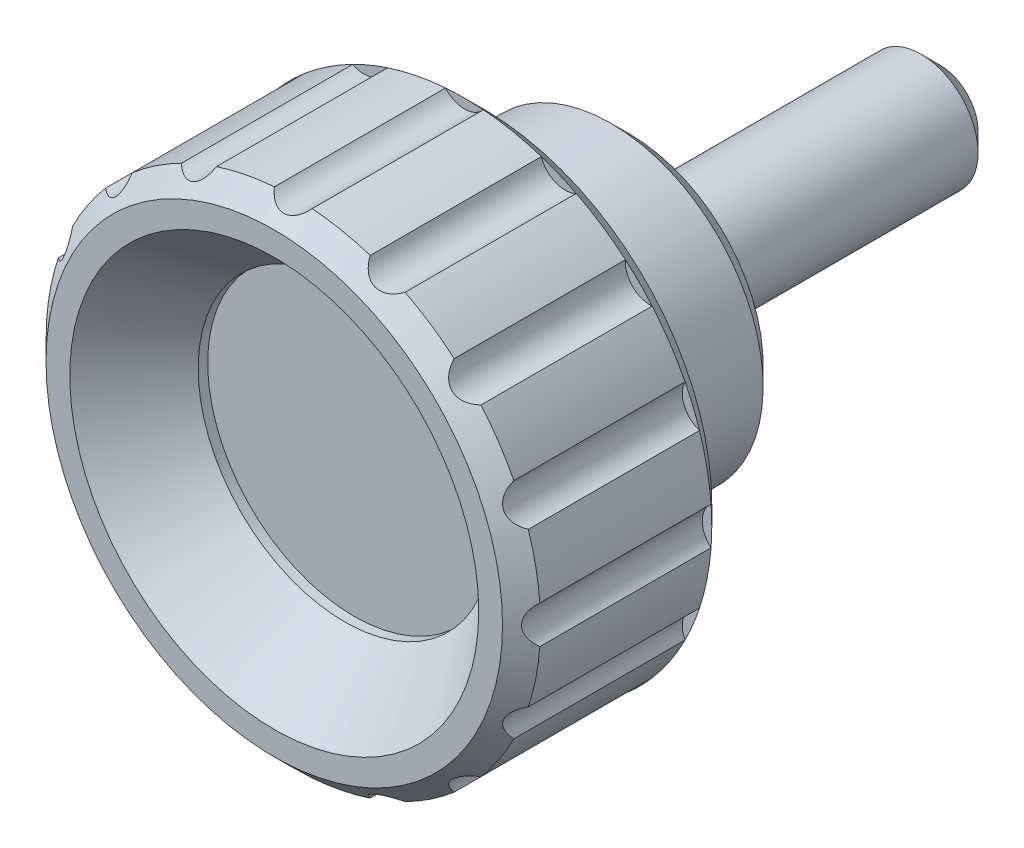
ISO-10303-21;
HEADER;
FILE_DESCRIPTION(('STEP AP214'),'2;1');
FILE_NAME('part.step','',(''),(''),'','','');
FILE_SCHEMA(('AUTOMOTIVE_DESIGN { 1 0 10303 214 1 1 1 1 }'));
ENDSEC;
DATA;
#1=APPLICATION_CONTEXT('core data for automotive mechanical design processes');
#2=APPLICATION_PROTOCOL_DEFINITION('international standard','automotive_design',2000,#1);
#3=PRODUCT_CONTEXT('',#1,'mechanical');
#4=PRODUCT('Part','Part','',(#3));
#5=PRODUCT_RELATED_PRODUCT_CATEGORY('part','',(#4));
#6=PRODUCT_DEFINITION_FORMATION('','',#4);
#7=PRODUCT_DEFINITION_CONTEXT('part definition',#1,'design');
#8=PRODUCT_DEFINITION('design','',#6,#7);
#9=PRODUCT_DEFINITION_SHAPE('','',#8);
#10=(LENGTH_UNIT() NAMED_UNIT(*) SI_UNIT(.MILLI.,.METRE.));
#11=(NAMED_UNIT(*) PLANE_ANGLE_UNIT() SI_UNIT($,.RADIAN.));
#12=(NAMED_UNIT(*) SI_UNIT($,.STERADIAN.) SOLID_ANGLE_UNIT());
#13=UNCERTAINTY_MEASURE_WITH_UNIT(LENGTH_MEASURE(1.E-05),#10,'distance_accuracy_value','');
#14=(GEOMETRIC_REPRESENTATION_CONTEXT(3) GLOBAL_UNCERTAINTY_ASSIGNED_CONTEXT((#13)) GLOBAL_UNIT_ASSIGNED_CONTEXT((#10,
#11,#12)) REPRESENTATION_CONTEXT('',''));
#15=CARTESIAN_POINT('',(0.,0.,0.));
#16=DIRECTION('',(0.,0.,1.));
#17=DIRECTION('',(1.,0.,0.));
#18=AXIS2_PLACEMENT_3D('',#15,#16,#17);
#19=CARTESIAN_POINT('',(-6.39920215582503E-13,-5.50485583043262E-13,7.99999999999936));
#20=DIRECTION('',(0.,0.,1.));
#21=DIRECTION('',(1.,0.,0.));
#22=AXIS2_PLACEMENT_3D('',#19,#20,#21);
#23=CYLINDRICAL_SURFACE('',#22,12.9999999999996);
#24=CARTESIAN_POINT('',(-1.43982048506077E-12,-1.23859256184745E-12,18.));
#25=DIRECTION('',(0.,0.,1.));
#26=DIRECTION('',(1.,0.,0.));
#27=AXIS2_PLACEMENT_3D('',#24,#25,#26);
#28=CIRCLE('',#27,12.9999999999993);
#29=CARTESIAN_POINT('',(-4.04215376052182,-12.3556057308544,17.9999999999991));
#30=VERTEX_POINT('',#29);
#31=CARTESIAN_POINT('',(-0.99382248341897,-12.9619565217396,17.9999999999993));
#32=VERTEX_POINT('',#31);
#33=EDGE_CURVE('E410',#30,#32,#28,.T.);
#34=ORIENTED_EDGE('',*,*,#33,.F.);
#35=DIRECTION('',(0.,0.,1.));
#36=VECTOR('',#35,1.);
#37=CARTESIAN_POINT('',(-4.04215376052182,-12.3556057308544,14.));
#38=LINE('',#37,#36);
#39=CARTESIAN_POINT('',(-4.04215376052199,-12.3556057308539,9.));
#40=VERTEX_POINT('',#39);
#41=EDGE_CURVE('E616',#30,#40,#38,.F.);
#42=ORIENTED_EDGE('',*,*,#41,.T.);
#43=CARTESIAN_POINT('',(-7.19910242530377E-13,-6.19296280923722E-13,9.));
#44=DIRECTION('',(0.,0.,1.));
#45=DIRECTION('',(1.,0.,0.));
#46=AXIS2_PLACEMENT_3D('',#43,#44,#45);
#47=CIRCLE('',#46,13.);
#48=CARTESIAN_POINT('',(-0.993822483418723,-12.9619565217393,9.));
#49=VERTEX_POINT('',#48);
#50=EDGE_CURVE('E474',#40,#49,#47,.T.);
#51=ORIENTED_EDGE('',*,*,#50,.T.);
#52=DIRECTION('',(0.,0.,1.));
#53=VECTOR('',#52,1.);
#54=CARTESIAN_POINT('',(-0.993822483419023,-12.9619565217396,14.));
#55=LINE('',#54,#53);
#56=EDGE_CURVE('E584',#49,#32,#55,.T.);
#57=ORIENTED_EDGE('',*,*,#56,.T.);
#58=EDGE_LOOP('',(#34,#42,#51,#57));
#59=FACE_BOUND('',#58,.T.);
#60=ADVANCED_FACE('F14',(#59),#23,.T.);
#61=CARTESIAN_POINT('',(-8.46274873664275,-9.86822597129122,9.));
#62=VERTEX_POINT('',#61);
#63=CARTESIAN_POINT('',(-5.87849826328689,-11.5949669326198,9.));
#64=VERTEX_POINT('',#63);
#65=EDGE_CURVE('E484',#62,#64,#47,.T.);
#66=ORIENTED_EDGE('',*,*,#65,.T.);
#67=DIRECTION('',(0.,0.,1.));
#68=VECTOR('',#67,1.);
#69=CARTESIAN_POINT('',(-5.87849826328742,-11.5949669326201,14.));
#70=LINE('',#69,#68);
#71=CARTESIAN_POINT('',(-5.87849826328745,-11.5949669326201,17.999999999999));
#72=VERTEX_POINT('',#71);
#73=EDGE_CURVE('E614',#64,#72,#70,.T.);
#74=ORIENTED_EDGE('',*,*,#73,.T.);
#75=CARTESIAN_POINT('',(-8.46274873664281,-9.86822597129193,17.9999999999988));
#76=VERTEX_POINT('',#75);
#77=EDGE_CURVE('E406',#76,#72,#28,.T.);
#78=ORIENTED_EDGE('',*,*,#77,.F.);
#79=DIRECTION('',(0.,0.,1.));
#80=VECTOR('',#79,1.);
#81=CARTESIAN_POINT('',(-8.46274873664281,-9.86822597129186,14.));
#82=LINE('',#81,#80);
#83=EDGE_CURVE('E612',#76,#62,#82,.F.);
#84=ORIENTED_EDGE('',*,*,#83,.T.);
#85=EDGE_LOOP('',(#66,#74,#78,#84));
#86=FACE_BOUND('',#85,.T.);
#87=ADVANCED_FACE('F343',(#86),#23,.T.);
#88=CARTESIAN_POINT('',(-11.5949669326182,-5.87849826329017,9.));
#89=VERTEX_POINT('',#88);
#90=CARTESIAN_POINT('',(-9.86822597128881,-8.46274873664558,9.));
#91=VERTEX_POINT('',#90);
#92=EDGE_CURVE('E494',#89,#91,#47,.T.);
#93=ORIENTED_EDGE('',*,*,#92,.T.);
#94=DIRECTION('',(0.,0.,1.));
#95=VECTOR('',#94,1.);
#96=CARTESIAN_POINT('',(-9.86822597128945,-8.46274873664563,14.));
#97=LINE('',#96,#95);
#98=CARTESIAN_POINT('',(-9.86822597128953,-8.46274873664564,17.9999999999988));
#99=VERTEX_POINT('',#98);
#100=EDGE_CURVE('E610',#91,#99,#97,.T.);
#101=ORIENTED_EDGE('',*,*,#100,.T.);
#102=CARTESIAN_POINT('',(-11.5949669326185,-5.87849826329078,17.9999999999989));
#103=VERTEX_POINT('',#102);
#104=EDGE_CURVE('E402',#103,#99,#28,.T.);
#105=ORIENTED_EDGE('',*,*,#104,.F.);
#106=DIRECTION('',(0.,0.,1.));
#107=VECTOR('',#106,1.);
#108=CARTESIAN_POINT('',(-11.5949669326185,-5.87849826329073,14.));
#109=LINE('',#108,#107);
#110=EDGE_CURVE('E608',#103,#89,#109,.F.);
#111=ORIENTED_EDGE('',*,*,#110,.T.);
#112=EDGE_LOOP('',(#93,#101,#105,#111));
#113=FACE_BOUND('',#112,.T.);
#114=ADVANCED_FACE('F349',(#113),#23,.T.);
#115=CARTESIAN_POINT('',(-12.9619565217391,-0.993822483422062,9.));
#116=VERTEX_POINT('',#115);
#117=CARTESIAN_POINT('',(-12.3556057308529,-4.04215376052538,9.));
#118=VERTEX_POINT('',#117);
#119=EDGE_CURVE('E505',#116,#118,#47,.T.);
#120=ORIENTED_EDGE('',*,*,#119,.T.);
#121=DIRECTION('',(0.,0.,1.));
#122=VECTOR('',#121,1.);
#123=CARTESIAN_POINT('',(-12.3556057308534,-4.0421537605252,14.));
#124=LINE('',#123,#122);
#125=CARTESIAN_POINT('',(-12.3556057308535,-4.04215376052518,17.999999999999));
#126=VERTEX_POINT('',#125);
#127=EDGE_CURVE('E606',#118,#126,#124,.T.);
#128=ORIENTED_EDGE('',*,*,#127,.T.);
#129=CARTESIAN_POINT('',(-12.9619565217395,-0.993822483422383,17.9999999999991));
#130=VERTEX_POINT('',#129);
#131=EDGE_CURVE('E398',#130,#126,#28,.T.);
#132=ORIENTED_EDGE('',*,*,#131,.F.);
#133=DIRECTION('',(0.,0.,1.));
#134=VECTOR('',#133,1.);
#135=CARTESIAN_POINT('',(-12.9619565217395,-0.993822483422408,14.));
#136=LINE('',#135,#134);
#137=EDGE_CURVE('E604',#130,#116,#136,.F.);
#138=ORIENTED_EDGE('',*,*,#137,.T.);
#139=EDGE_LOOP('',(#120,#128,#132,#138));
#140=FACE_BOUND('',#139,.T.);
#141=ADVANCED_FACE('F1087',(#140),#23,.T.);
#142=CARTESIAN_POINT('',(-12.3556057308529,4.04215376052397,9.));
#143=VERTEX_POINT('',#142);
#144=CARTESIAN_POINT('',(-12.9619565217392,0.9938224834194,9.));
#145=VERTEX_POINT('',#144);
#146=EDGE_CURVE('E516',#143,#145,#47,.T.);
#147=ORIENTED_EDGE('',*,*,#146,.T.);
#148=DIRECTION('',(0.,0.,1.));
#149=VECTOR('',#148,1.);
#150=CARTESIAN_POINT('',(-12.9619565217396,0.993822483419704,14.));
#151=LINE('',#150,#149);
#152=CARTESIAN_POINT('',(-12.9619565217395,0.993822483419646,17.9999999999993));
#153=VERTEX_POINT('',#152);
#154=EDGE_CURVE('E602',#145,#153,#151,.T.);
#155=ORIENTED_EDGE('',*,*,#154,.T.);
#156=CARTESIAN_POINT('',(-12.3556057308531,4.04215376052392,17.9999999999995));
#157=VERTEX_POINT('',#156);
#158=EDGE_CURVE('E394',#157,#153,#28,.T.);
#159=ORIENTED_EDGE('',*,*,#158,.F.);
#160=DIRECTION('',(0.,0.,1.));
#161=VECTOR('',#160,1.);
#162=CARTESIAN_POINT('',(-12.3556057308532,4.04215376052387,14.));
#163=LINE('',#162,#161);
#164=EDGE_CURVE('E600',#157,#143,#163,.F.);
#165=ORIENTED_EDGE('',*,*,#164,.T.);
#166=EDGE_LOOP('',(#147,#155,#159,#165));
#167=FACE_BOUND('',#166,.T.);
#168=ADVANCED_FACE('F1079',(#167),#23,.T.);
#169=CARTESIAN_POINT('',(-9.86822597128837,8.46274873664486,9.));
#170=VERTEX_POINT('',#169);
#171=CARTESIAN_POINT('',(-11.5949669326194,5.87849826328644,9.));
#172=VERTEX_POINT('',#171);
#173=EDGE_CURVE('E527',#170,#172,#47,.T.);
#174=ORIENTED_EDGE('',*,*,#173,.T.);
#175=DIRECTION('',(0.,0.,1.));
#176=VECTOR('',#175,1.);
#177=CARTESIAN_POINT('',(-11.5949669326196,5.87849826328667,14.));
#178=LINE('',#177,#176);
#179=CARTESIAN_POINT('',(-11.5949669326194,5.87849826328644,17.9999999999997));
#180=VERTEX_POINT('',#179);
#181=EDGE_CURVE('E598',#172,#180,#178,.T.);
#182=ORIENTED_EDGE('',*,*,#181,.T.);
#183=CARTESIAN_POINT('',(-9.8682259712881,8.46274873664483,18.));
#184=VERTEX_POINT('',#183);
#185=EDGE_CURVE('E390',#184,#180,#28,.T.);
#186=ORIENTED_EDGE('',*,*,#185,.F.);
#187=DIRECTION('',(0.,0.,1.));
#188=VECTOR('',#187,1.);
#189=CARTESIAN_POINT('',(-9.86822597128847,8.46274873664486,14.));
#190=LINE('',#189,#188);
#191=EDGE_CURVE('E596',#184,#170,#190,.F.);
#192=ORIENTED_EDGE('',*,*,#191,.T.);
#193=EDGE_LOOP('',(#174,#182,#186,#192));
#194=FACE_BOUND('',#193,.T.);
#195=ADVANCED_FACE('F1071',(#194),#23,.T.);
#196=CARTESIAN_POINT('',(-5.87849826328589,11.5949669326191,9.));
#197=VERTEX_POINT('',#196);
#198=CARTESIAN_POINT('',(-8.4627487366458,9.86822597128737,9.));
#199=VERTEX_POINT('',#198);
#200=EDGE_CURVE('E538',#197,#199,#47,.T.);
#201=ORIENTED_EDGE('',*,*,#200,.T.);
#202=DIRECTION('',(0.,0.,1.));
#203=VECTOR('',#202,1.);
#204=CARTESIAN_POINT('',(-8.4627487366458,9.86822597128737,14.));
#205=LINE('',#204,#203);
#206=CARTESIAN_POINT('',(-8.46274873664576,9.86822597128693,18.));
#207=VERTEX_POINT('',#206);
#208=EDGE_CURVE('E594',#199,#207,#205,.T.);
#209=ORIENTED_EDGE('',*,*,#208,.T.);
#210=CARTESIAN_POINT('',(-5.87849826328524,11.5949669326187,18.0000000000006));
#211=VERTEX_POINT('',#210);
#212=EDGE_CURVE('E386',#211,#207,#28,.T.);
#213=ORIENTED_EDGE('',*,*,#212,.F.);
#214=DIRECTION('',(0.,0.,1.));
#215=VECTOR('',#214,1.);
#216=CARTESIAN_POINT('',(-5.87849826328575,11.594966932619,14.));
#217=LINE('',#216,#215);
#218=EDGE_CURVE('E592',#211,#197,#217,.F.);
#219=ORIENTED_EDGE('',*,*,#218,.T.);
#220=EDGE_LOOP('',(#201,#209,#213,#219));
#221=FACE_BOUND('',#220,.T.);
#222=ADVANCED_FACE('F1063',(#221),#23,.T.);
#223=CARTESIAN_POINT('',(-0.993822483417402,12.9619565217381,9.));
#224=VERTEX_POINT('',#223);
#225=CARTESIAN_POINT('',(-4.0421537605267,12.3556057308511,9.));
#226=VERTEX_POINT('',#225);
#227=EDGE_CURVE('E266',#224,#226,#47,.T.);
#228=ORIENTED_EDGE('',*,*,#227,.T.);
#229=DIRECTION('',(0.,0.,1.));
#230=VECTOR('',#229,1.);
#231=CARTESIAN_POINT('',(-4.04215376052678,12.3556057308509,14.));
#232=LINE('',#231,#230);
#233=CARTESIAN_POINT('',(-4.04215376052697,12.3556057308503,18.0000000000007));
#234=VERTEX_POINT('',#233);
#235=EDGE_CURVE('E558',#226,#234,#232,.T.);
#236=ORIENTED_EDGE('',*,*,#235,.T.);
#237=CARTESIAN_POINT('',(-0.993822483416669,12.9619565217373,18.0000000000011));
#238=VERTEX_POINT('',#237);
#239=EDGE_CURVE('E383',#238,#234,#28,.T.);
#240=ORIENTED_EDGE('',*,*,#239,.F.);
#241=DIRECTION('',(0.,0.,1.));
#242=VECTOR('',#241,1.);
#243=CARTESIAN_POINT('',(-0.993822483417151,12.9619565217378,14.));
#244=LINE('',#243,#242);
#245=EDGE_CURVE('E559',#238,#224,#244,.F.);
#246=ORIENTED_EDGE('',*,*,#245,.T.);
#247=EDGE_LOOP('',(#228,#236,#240,#246));
#248=FACE_BOUND('',#247,.T.);
#249=ADVANCED_FACE('F557',(#248),#23,.T.);
#250=CARTESIAN_POINT('',(0.993822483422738,-12.9619565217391,17.9999999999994));
#251=VERTEX_POINT('',#250);
#252=CARTESIAN_POINT('',(4.04215376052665,-12.3556057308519,17.9999999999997));
#253=VERTEX_POINT('',#252);
#254=EDGE_CURVE('E413',#251,#253,#28,.T.);
#255=ORIENTED_EDGE('',*,*,#254,.F.);
#256=DIRECTION('',(0.,0.,1.));
#257=VECTOR('',#256,1.);
#258=CARTESIAN_POINT('',(0.993822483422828,-12.9619565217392,14.));
#259=LINE('',#258,#257);
#260=CARTESIAN_POINT('',(0.993822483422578,-12.9619565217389,9.));
#261=VERTEX_POINT('',#260);
#262=EDGE_CURVE('E586',#251,#261,#259,.F.);
#263=ORIENTED_EDGE('',*,*,#262,.T.);
#264=CARTESIAN_POINT('',(4.04215376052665,-12.3556057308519,9.));
#265=VERTEX_POINT('',#264);
#266=EDGE_CURVE('E463',#261,#265,#47,.T.);
#267=ORIENTED_EDGE('',*,*,#266,.T.);
#268=DIRECTION('',(0.,0.,1.));
#269=VECTOR('',#268,1.);
#270=CARTESIAN_POINT('',(4.04215376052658,-12.3556057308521,14.));
#271=LINE('',#270,#269);
#272=EDGE_CURVE('E580',#265,#253,#271,.T.);
#273=ORIENTED_EDGE('',*,*,#272,.T.);
#274=EDGE_LOOP('',(#255,#263,#267,#273));
#275=FACE_BOUND('',#274,.T.);
#276=ADVANCED_FACE('F1048',(#275),#23,.T.);
#277=CARTESIAN_POINT('',(5.87849826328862,-11.594966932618,18.));
#278=VERTEX_POINT('',#277);
#279=CARTESIAN_POINT('',(8.46274873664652,-9.86822597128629,18.));
#280=VERTEX_POINT('',#279);
#281=EDGE_CURVE('E416',#278,#280,#28,.T.);
#282=ORIENTED_EDGE('',*,*,#281,.F.);
#283=DIRECTION('',(0.,0.,1.));
#284=VECTOR('',#283,1.);
#285=CARTESIAN_POINT('',(5.87849826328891,-11.5949669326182,14.));
#286=LINE('',#285,#284);
#287=CARTESIAN_POINT('',(5.87849826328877,-11.5949669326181,9.));
#288=VERTEX_POINT('',#287);
#289=EDGE_CURVE('E582',#278,#288,#286,.F.);
#290=ORIENTED_EDGE('',*,*,#289,.T.);
#291=CARTESIAN_POINT('',(8.46274873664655,-9.86822597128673,9.));
#292=VERTEX_POINT('',#291);
#293=EDGE_CURVE('E453',#288,#292,#47,.T.);
#294=ORIENTED_EDGE('',*,*,#293,.T.);
#295=DIRECTION('',(0.,0.,1.));
#296=VECTOR('',#295,1.);
#297=CARTESIAN_POINT('',(8.46274873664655,-9.86822597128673,14.));
#298=LINE('',#297,#296);
#299=EDGE_CURVE('E577',#292,#280,#298,.T.);
#300=ORIENTED_EDGE('',*,*,#299,.T.);
#301=EDGE_LOOP('',(#282,#290,#294,#300));
#302=FACE_BOUND('',#301,.T.);
#303=ADVANCED_FACE('F1033',(#302),#23,.T.);
#304=CARTESIAN_POINT('',(9.86822597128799,-8.46274873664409,18.0000000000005));
#305=VERTEX_POINT('',#304);
#306=CARTESIAN_POINT('',(11.5949669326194,-5.87849826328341,18.0000000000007));
#307=VERTEX_POINT('',#306);
#308=EDGE_CURVE('E420',#305,#307,#28,.T.);
#309=ORIENTED_EDGE('',*,*,#308,.F.);
#310=DIRECTION('',(0.,0.,1.));
#311=VECTOR('',#310,1.);
#312=CARTESIAN_POINT('',(9.86822597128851,-8.46274873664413,14.));
#313=LINE('',#312,#311);
#314=CARTESIAN_POINT('',(9.86822597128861,-8.46274873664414,9.));
#315=VERTEX_POINT('',#314);
#316=EDGE_CURVE('E43',#305,#315,#313,.F.);
#317=ORIENTED_EDGE('',*,*,#316,.T.);
#318=CARTESIAN_POINT('',(11.5949669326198,-5.8784982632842,9.));
#319=VERTEX_POINT('',#318);
#320=EDGE_CURVE('E444',#315,#319,#47,.T.);
#321=ORIENTED_EDGE('',*,*,#320,.T.);
#322=DIRECTION('',(0.,0.,1.));
#323=VECTOR('',#322,1.);
#324=CARTESIAN_POINT('',(11.5949669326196,-5.87849826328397,14.));
#325=LINE('',#324,#323);
#326=EDGE_CURVE('E568',#319,#307,#325,.T.);
#327=ORIENTED_EDGE('',*,*,#326,.T.);
#328=EDGE_LOOP('',(#309,#317,#321,#327));
#329=FACE_BOUND('',#328,.T.);
#330=ADVANCED_FACE('F1027',(#329),#23,.T.);
#331=CARTESIAN_POINT('',(12.3556057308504,-4.04215376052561,18.0000000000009));
#332=VERTEX_POINT('',#331);
#333=CARTESIAN_POINT('',(12.9619565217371,-0.993822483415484,18.0000000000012));
#334=VERTEX_POINT('',#333);
#335=EDGE_CURVE('E423',#332,#334,#28,.T.);
#336=ORIENTED_EDGE('',*,*,#335,.F.);
#337=DIRECTION('',(0.,0.,1.));
#338=VECTOR('',#337,1.);
#339=CARTESIAN_POINT('',(12.3556057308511,-4.04215376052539,14.));
#340=LINE('',#339,#338);
#341=CARTESIAN_POINT('',(12.3556057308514,-4.04215376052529,9.));
#342=VERTEX_POINT('',#341);
#343=EDGE_CURVE('E35',#332,#342,#340,.F.);
#344=ORIENTED_EDGE('',*,*,#343,.T.);
#345=CARTESIAN_POINT('',(12.9619565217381,-0.993822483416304,9.));
#346=VERTEX_POINT('',#345);
#347=EDGE_CURVE('E434',#342,#346,#47,.T.);
#348=ORIENTED_EDGE('',*,*,#347,.T.);
#349=DIRECTION('',(0.,0.,1.));
#350=VECTOR('',#349,1.);
#351=CARTESIAN_POINT('',(12.9619565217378,-0.993822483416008,14.));
#352=LINE('',#351,#350);
#353=EDGE_CURVE('E569',#346,#334,#352,.T.);
#354=ORIENTED_EDGE('',*,*,#353,.T.);
#355=EDGE_LOOP('',(#336,#344,#348,#354));
#356=FACE_BOUND('',#355,.T.);
#357=ADVANCED_FACE('F1032',(#356),#23,.T.);
#358=CARTESIAN_POINT('',(12.9619565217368,0.993822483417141,18.0000000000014));
#359=VERTEX_POINT('',#358);
#360=CARTESIAN_POINT('',(12.3556057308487,4.04215376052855,18.0000000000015));
#361=VERTEX_POINT('',#360);
#362=EDGE_CURVE('E274',#359,#361,#28,.T.);
#363=ORIENTED_EDGE('',*,*,#362,.F.);
#364=DIRECTION('',(0.,0.,1.));
#365=VECTOR('',#364,1.);
#366=CARTESIAN_POINT('',(12.9619565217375,0.993822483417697,14.));
#367=LINE('',#366,#365);
#368=CARTESIAN_POINT('',(12.9619565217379,0.993822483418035,9.));
#369=VERTEX_POINT('',#368);
#370=EDGE_CURVE('E566',#359,#369,#367,.F.);
#371=ORIENTED_EDGE('',*,*,#370,.T.);
#372=CARTESIAN_POINT('',(12.3556057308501,4.04215376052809,9.));
#373=VERTEX_POINT('',#372);
#374=EDGE_CURVE('E267',#369,#373,#47,.T.);
#375=ORIENTED_EDGE('',*,*,#374,.T.);
#376=DIRECTION('',(0.,0.,1.));
#377=VECTOR('',#376,1.);
#378=CARTESIAN_POINT('',(12.3556057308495,4.04215376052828,14.));
#379=LINE('',#378,#377);
#380=EDGE_CURVE('E565',#373,#361,#379,.T.);
#381=ORIENTED_EDGE('',*,*,#380,.T.);
#382=EDGE_LOOP('',(#363,#371,#375,#381));
#383=FACE_BOUND('',#382,.T.);
#384=ADVANCED_FACE('F372',(#383),#23,.T.);
#385=CARTESIAN_POINT('',(11.5949669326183,5.87849826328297,18.0000000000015));
#386=VERTEX_POINT('',#385);
#387=CARTESIAN_POINT('',(9.86822597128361,8.46274873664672,18.0000000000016));
#388=VERTEX_POINT('',#387);
#389=EDGE_CURVE('E381',#386,#388,#28,.T.);
#390=ORIENTED_EDGE('',*,*,#389,.F.);
#391=DIRECTION('',(0.,0.,1.));
#392=VECTOR('',#391,1.);
#393=CARTESIAN_POINT('',(11.5949669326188,5.87849826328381,14.));
#394=LINE('',#393,#392);
#395=CARTESIAN_POINT('',(11.594966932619,5.87849826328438,9.));
#396=VERTEX_POINT('',#395);
#397=EDGE_CURVE('E572',#386,#396,#394,.F.);
#398=ORIENTED_EDGE('',*,*,#397,.T.);
#399=CARTESIAN_POINT('',(9.86822597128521,8.46274873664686,9.));
#400=VERTEX_POINT('',#399);
#401=EDGE_CURVE('E1164',#396,#400,#47,.T.);
#402=ORIENTED_EDGE('',*,*,#401,.T.);
#403=DIRECTION('',(0.,0.,1.));
#404=VECTOR('',#403,1.);
#405=CARTESIAN_POINT('',(9.86822597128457,8.4627487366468,14.));
#406=LINE('',#405,#404);
#407=EDGE_CURVE('E258',#400,#388,#406,.T.);
#408=ORIENTED_EDGE('',*,*,#407,.T.);
#409=EDGE_LOOP('',(#390,#398,#402,#408));
#410=FACE_BOUND('',#409,.T.);
#411=ADVANCED_FACE('F362',(#410),#23,.T.);
#412=CARTESIAN_POINT('',(8.4627487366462,9.86822597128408,18.0000000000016));
#413=VERTEX_POINT('',#412);
#414=CARTESIAN_POINT('',(5.87849826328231,11.5949669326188,18.0000000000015));
#415=VERTEX_POINT('',#414);
#416=EDGE_CURVE('E377',#413,#415,#28,.T.);
#417=ORIENTED_EDGE('',*,*,#416,.F.);
#418=DIRECTION('',(0.,0.,1.));
#419=VECTOR('',#418,1.);
#420=CARTESIAN_POINT('',(8.46274873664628,9.86822597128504,14.));
#421=LINE('',#420,#419);
#422=CARTESIAN_POINT('',(8.46274873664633,9.86822597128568,9.));
#423=VERTEX_POINT('',#422);
#424=EDGE_CURVE('E378',#413,#423,#421,.F.);
#425=ORIENTED_EDGE('',*,*,#424,.T.);
#426=CARTESIAN_POINT('',(5.87849826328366,11.5949669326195,9.));
#427=VERTEX_POINT('',#426);
#428=EDGE_CURVE('E239',#423,#427,#47,.T.);
#429=ORIENTED_EDGE('',*,*,#428,.T.);
#430=DIRECTION('',(0.,0.,1.));
#431=VECTOR('',#430,1.);
#432=CARTESIAN_POINT('',(5.87849826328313,11.5949669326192,14.));
#433=LINE('',#432,#431);
#434=EDGE_CURVE('E248',#427,#415,#433,.T.);
#435=ORIENTED_EDGE('',*,*,#434,.T.);
#436=EDGE_LOOP('',(#417,#425,#429,#435));
#437=FACE_BOUND('',#436,.T.);
#438=ADVANCED_FACE('F354',(#437),#23,.T.);
#439=CARTESIAN_POINT('',(10.2499999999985,-1.30740325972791E-12,19.0000000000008));
#440=DIRECTION('',(0.,0.,1.));
#441=DIRECTION('',(0.,-1.,0.));
#442=AXIS2_PLACEMENT_3D('',#439,#440,#441);
#443=PLANE('',#442);
#444=CARTESIAN_POINT('',(-1.51981051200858E-12,-1.30740325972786E-12,19.));
#445=DIRECTION('',(0.,0.,1.));
#446=DIRECTION('',(1.,0.,0.));
#447=AXIS2_PLACEMENT_3D('',#444,#445,#446);
#448=CIRCLE('',#447,11.9999999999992);
#449=CARTESIAN_POINT('',(11.9999999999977,-1.30740325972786E-12,19.000000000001));
#450=VERTEX_POINT('',#449);
#451=EDGE_CURVE('E426',#450,#450,#448,.T.);
#452=ORIENTED_EDGE('',*,*,#451,.T.);
#453=EDGE_LOOP('',(#452));
#454=FACE_BOUND('',#453,.T.);
#455=CARTESIAN_POINT('',(-1.51981051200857E-12,-1.30740325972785E-12,19.));
#456=DIRECTION('',(0.,0.,1.));
#457=DIRECTION('',(1.,0.,0.));
#458=AXIS2_PLACEMENT_3D('',#455,#456,#457);
#459=CIRCLE('',#458,10.75);
#460=CARTESIAN_POINT('',(10.7499999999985,-1.30740325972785E-12,19.0000000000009));
#461=VERTEX_POINT('',#460);
#462=EDGE_CURVE('E430',#461,#461,#459,.T.);
#463=ORIENTED_EDGE('',*,*,#462,.F.);
#464=EDGE_LOOP('',(#463));
#465=FACE_BOUND('',#464,.T.);
#466=ADVANCED_FACE('F361',(#454,#465),#443,.T.);
#467=CARTESIAN_POINT('',(7.,0.,0.30000000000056));
#468=DIRECTION('',(0.,0.,-1.));
#469=DIRECTION('',(0.,1.,0.));
#470=AXIS2_PLACEMENT_3D('',#467,#468,#469);
#471=PLANE('',#470);
#472=CARTESIAN_POINT('',(0.,0.,0.3));
#473=DIRECTION('',(0.,0.,-1.));
#474=DIRECTION('',(-1.,0.,0.));
#475=AXIS2_PLACEMENT_3D('',#472,#473,#474);
#476=CIRCLE('',#475,4.8);
#477=CARTESIAN_POINT('',(-4.80000000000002,0.,0.299999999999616));
#478=VERTEX_POINT('',#477);
#479=EDGE_CURVE('E302',#478,#478,#476,.T.);
#480=ORIENTED_EDGE('',*,*,#479,.F.);
#481=EDGE_LOOP('',(#480));
#482=FACE_BOUND('',#481,.T.);
#483=CARTESIAN_POINT('',(0.,0.,0.3));
#484=DIRECTION('',(0.,0.,-1.));
#485=DIRECTION('',(0.,1.,0.));
#486=AXIS2_PLACEMENT_3D('',#483,#484,#485);
#487=CIRCLE('',#486,7.);
#488=CARTESIAN_POINT('',(0.,6.99999999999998,0.300000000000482));
#489=VERTEX_POINT('',#488);
#490=EDGE_CURVE('E284',#489,#489,#487,.T.);
#491=ORIENTED_EDGE('',*,*,#490,.T.);
#492=EDGE_LOOP('',(#491));
#493=FACE_BOUND('',#492,.T.);
#494=ADVANCED_FACE('F369',(#482,#493),#471,.T.);
#495=CARTESIAN_POINT('',(11.4999999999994,-5.50485583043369E-13,8.00000000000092));
#496=DIRECTION('',(0.,0.,-1.));
#497=DIRECTION('',(0.,1.,0.));
#498=AXIS2_PLACEMENT_3D('',#495,#496,#497);
#499=PLANE('',#498);
#500=CARTESIAN_POINT('',(-6.39920215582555E-13,-5.50485583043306E-13,8.));
#501=DIRECTION('',(0.,0.,-1.));
#502=DIRECTION('',(0.,1.,0.));
#503=AXIS2_PLACEMENT_3D('',#500,#501,#502);
#504=CIRCLE('',#503,8.);
#505=CARTESIAN_POINT('',(-6.39920215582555E-13,7.99999999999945,8.00000000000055));
#506=VERTEX_POINT('',#505);
#507=EDGE_CURVE('E290',#506,#506,#504,.T.);
#508=ORIENTED_EDGE('',*,*,#507,.F.);
#509=EDGE_LOOP('',(#508));
#510=FACE_BOUND('',#509,.T.);
#511=CARTESIAN_POINT('',(-6.39920215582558E-13,-5.50485583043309E-13,8.));
#512=DIRECTION('',(0.,0.,1.));
#513=DIRECTION('',(1.,0.,0.));
#514=AXIS2_PLACEMENT_3D('',#511,#512,#513);
#515=CIRCLE('',#514,12.);
#516=CARTESIAN_POINT('',(11.9999999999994,-5.50485583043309E-13,8.00000000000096));
#517=VERTEX_POINT('',#516);
#518=EDGE_CURVE('E271',#517,#517,#515,.T.);
#519=ORIENTED_EDGE('',*,*,#518,.F.);
#520=EDGE_LOOP('',(#519));
#521=FACE_BOUND('',#520,.T.);
#522=ADVANCED_FACE('F633',(#510,#521),#499,.T.);
#523=CARTESIAN_POINT('',(0.,0.,0.3));
#524=DIRECTION('',(0.,0.,-1.));
#525=DIRECTION('',(0.,1.,0.));
#526=AXIS2_PLACEMENT_3D('',#523,#524,#525);
#527=CYLINDRICAL_SURFACE('',#526,8.);
#528=ORIENTED_EDGE('',*,*,#507,.T.);
#529=EDGE_LOOP('',(#528));
#530=FACE_BOUND('',#529,.T.);
#531=CARTESIAN_POINT('',(-1.03987035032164E-13,0.,1.3));
#532=DIRECTION('',(0.,0.,-1.));
#533=DIRECTION('',(0.,1.,0.));
#534=AXIS2_PLACEMENT_3D('',#531,#532,#533);
#535=CIRCLE('',#534,8.);
#536=CARTESIAN_POINT('',(-1.03987035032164E-13,7.99999999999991,1.30000000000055));
#537=VERTEX_POINT('',#536);
#538=EDGE_CURVE('E287',#537,#537,#535,.T.);
#539=ORIENTED_EDGE('',*,*,#538,.F.);
#540=EDGE_LOOP('',(#539));
#541=FACE_BOUND('',#540,.T.);
#542=ADVANCED_FACE('F636',(#530,#541),#527,.T.);
#543=CARTESIAN_POINT('',(0.,0.,0.3));
#544=DIRECTION('',(0.,0.,1.));
#545=DIRECTION('',(0.,-1.,0.));
#546=AXIS2_PLACEMENT_3D('',#543,#544,#545);
#547=CONICAL_SURFACE('',#546,7.,0.785398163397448);
#548=ORIENTED_EDGE('',*,*,#538,.T.);
#549=EDGE_LOOP('',(#548));
#550=FACE_BOUND('',#549,.T.);
#551=ORIENTED_EDGE('',*,*,#490,.F.);
#552=EDGE_LOOP('',(#551));
#553=FACE_BOUND('',#552,.T.);
#554=ADVANCED_FACE('F640',(#550,#553),#547,.T.);
#555=CARTESIAN_POINT('',(-1.10997762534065E-12,-9.54848222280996E-13,13.8764501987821));
#556=DIRECTION('',(0.,0.,-1.));
#557=DIRECTION('',(-1.,0.,0.));
#558=AXIS2_PLACEMENT_3D('',#555,#556,#557);
#559=CYLINDRICAL_SURFACE('',#558,4.8);
#560=ORIENTED_EDGE('',*,*,#479,.T.);
#561=EDGE_LOOP('',(#560));
#562=FACE_BOUND('',#561,.T.);
#563=CARTESIAN_POINT('',(0.,0.,0.));
#564=DIRECTION('',(0.,0.,-1.));
#565=DIRECTION('',(-1.,0.,0.));
#566=AXIS2_PLACEMENT_3D('',#563,#564,#565);
#567=CIRCLE('',#566,4.8);
#568=CARTESIAN_POINT('',(-4.8,0.,-3.83952129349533E-13));
#569=VERTEX_POINT('',#568);
#570=EDGE_CURVE('E278',#569,#569,#567,.T.);
#571=ORIENTED_EDGE('',*,*,#570,.F.);
#572=EDGE_LOOP('',(#571));
#573=FACE_BOUND('',#572,.T.);
#574=ADVANCED_FACE('F644',(#562,#573),#559,.T.);
#575=CARTESIAN_POINT('',(1.27984043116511E-12,1.10097116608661E-12,-16.));
#576=DIRECTION('',(0.,0.,-1.));
#577=DIRECTION('',(-1.,0.,0.));
#578=AXIS2_PLACEMENT_3D('',#575,#576,#577);
#579=PLANE('',#578);
#580=CARTESIAN_POINT('',(1.27984043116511E-12,1.10097116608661E-12,-16.));
#581=DIRECTION('',(0.,0.,-1.));
#582=DIRECTION('',(-1.,0.,0.));
#583=AXIS2_PLACEMENT_3D('',#580,#581,#582);
#584=CIRCLE('',#583,2.);
#585=CARTESIAN_POINT('',(-1.99999999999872,1.10097116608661E-12,-16.0000000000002));
#586=VERTEX_POINT('',#585);
#587=EDGE_CURVE('E296',#586,#586,#584,.T.);
#588=ORIENTED_EDGE('',*,*,#587,.T.);
#589=EDGE_LOOP('',(#588));
#590=FACE_BOUND('',#589,.T.);
#591=ADVANCED_FACE('F656',(#590),#579,.T.);
#592=CARTESIAN_POINT('',(1.27984043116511E-12,1.10097116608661E-12,-16.));
#593=DIRECTION('',(0.,0.,1.));
#594=DIRECTION('',(1.,0.,0.));
#595=AXIS2_PLACEMENT_3D('',#592,#593,#594);
#596=CONICAL_SURFACE('',#595,2.,0.785398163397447);
#597=CARTESIAN_POINT('',(1.19985040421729E-12,1.0321604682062E-12,-15.));
#598=DIRECTION('',(0.,0.,-1.));
#599=DIRECTION('',(-1.,0.,0.));
#600=AXIS2_PLACEMENT_3D('',#597,#598,#599);
#601=CIRCLE('',#600,3.);
#602=CARTESIAN_POINT('',(-2.9999999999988,1.0321604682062E-12,-15.0000000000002));
#603=VERTEX_POINT('',#602);
#604=EDGE_CURVE('E299',#603,#603,#601,.F.);
#605=ORIENTED_EDGE('',*,*,#604,.F.);
#606=EDGE_LOOP('',(#605));
#607=FACE_BOUND('',#606,.T.);
#608=ORIENTED_EDGE('',*,*,#587,.F.);
#609=EDGE_LOOP('',(#608));
#610=FACE_BOUND('',#609,.T.);
#611=ADVANCED_FACE('F16',(#607,#610),#596,.T.);
#612=CARTESIAN_POINT('',(1.27984043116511E-12,1.10097116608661E-12,-16.));
#613=DIRECTION('',(0.,0.,1.));
#614=DIRECTION('',(1.,0.,0.));
#615=AXIS2_PLACEMENT_3D('',#612,#613,#614);
#616=CYLINDRICAL_SURFACE('',#615,3.);
#617=ORIENTED_EDGE('',*,*,#604,.T.);
#618=EDGE_LOOP('',(#617));
#619=FACE_BOUND('',#618,.T.);
#620=CARTESIAN_POINT('',(0.,0.,0.));
#621=DIRECTION('',(0.,0.,-1.));
#622=DIRECTION('',(-1.,0.,0.));
#623=AXIS2_PLACEMENT_3D('',#620,#621,#622);
#624=CIRCLE('',#623,3.);
#625=CARTESIAN_POINT('',(-3.,0.,-2.39970080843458E-13));
#626=VERTEX_POINT('',#625);
#627=EDGE_CURVE('E281',#626,#626,#624,.T.);
#628=ORIENTED_EDGE('',*,*,#627,.T.);
#629=EDGE_LOOP('',(#628));
#630=FACE_BOUND('',#629,.T.);
#631=ADVANCED_FACE('F651',(#619,#630),#616,.T.);
#632=CARTESIAN_POINT('',(0.,0.,0.));
#633=DIRECTION('',(0.,0.,-1.));
#634=DIRECTION('',(-1.,0.,0.));
#635=AXIS2_PLACEMENT_3D('',#632,#633,#634);
#636=PLANE('',#635);
#637=ORIENTED_EDGE('',*,*,#627,.F.);
#638=EDGE_LOOP('',(#637));
#639=FACE_BOUND('',#638,.T.);
#640=ORIENTED_EDGE('',*,*,#570,.T.);
#641=EDGE_LOOP('',(#640));
#642=FACE_BOUND('',#641,.T.);
#643=ADVANCED_FACE('F359',(#639,#642),#636,.T.);
#644=CARTESIAN_POINT('',(-6.39920215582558E-13,-5.50485583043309E-13,8.));
#645=DIRECTION('',(0.,0.,1.));
#646=DIRECTION('',(1.,0.,0.));
#647=AXIS2_PLACEMENT_3D('',#644,#645,#646);
#648=CONICAL_SURFACE('',#647,12.,0.785398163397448);
#649=ORIENTED_EDGE('',*,*,#374,.F.);
#650=EDGE_CURVE('E273',#346,#369,#47,.T.);
#651=ORIENTED_EDGE('',*,*,#650,.F.);
#652=ORIENTED_EDGE('',*,*,#347,.F.);
#653=EDGE_CURVE('E440',#319,#342,#47,.T.);
#654=ORIENTED_EDGE('',*,*,#653,.F.);
#655=ORIENTED_EDGE('',*,*,#320,.F.);
#656=EDGE_CURVE('E449',#292,#315,#47,.T.);
#657=ORIENTED_EDGE('',*,*,#656,.F.);
#658=ORIENTED_EDGE('',*,*,#293,.F.);
#659=EDGE_CURVE('E458',#265,#288,#47,.T.);
#660=ORIENTED_EDGE('',*,*,#659,.F.);
#661=ORIENTED_EDGE('',*,*,#266,.F.);
#662=EDGE_CURVE('E469',#49,#261,#47,.T.);
#663=ORIENTED_EDGE('',*,*,#662,.F.);
#664=ORIENTED_EDGE('',*,*,#50,.F.);
#665=EDGE_CURVE('E480',#64,#40,#47,.T.);
#666=ORIENTED_EDGE('',*,*,#665,.F.);
#667=ORIENTED_EDGE('',*,*,#65,.F.);
#668=EDGE_CURVE('E490',#91,#62,#47,.T.);
#669=ORIENTED_EDGE('',*,*,#668,.F.);
#670=ORIENTED_EDGE('',*,*,#92,.F.);
#671=EDGE_CURVE('E500',#118,#89,#47,.T.);
#672=ORIENTED_EDGE('',*,*,#671,.F.);
#673=ORIENTED_EDGE('',*,*,#119,.F.);
#674=EDGE_CURVE('E511',#145,#116,#47,.T.);
#675=ORIENTED_EDGE('',*,*,#674,.F.);
#676=ORIENTED_EDGE('',*,*,#146,.F.);
#677=EDGE_CURVE('E522',#172,#143,#47,.T.);
#678=ORIENTED_EDGE('',*,*,#677,.F.);
#679=ORIENTED_EDGE('',*,*,#173,.F.);
#680=EDGE_CURVE('E533',#199,#170,#47,.T.);
#681=ORIENTED_EDGE('',*,*,#680,.F.);
#682=ORIENTED_EDGE('',*,*,#200,.F.);
#683=EDGE_CURVE('E544',#226,#197,#47,.T.);
#684=ORIENTED_EDGE('',*,*,#683,.F.);
#685=ORIENTED_EDGE('',*,*,#227,.F.);
#686=CARTESIAN_POINT('',(0.993822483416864,12.9619565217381,9.));
#687=VERTEX_POINT('',#686);
#688=EDGE_CURVE('E265',#687,#224,#47,.T.);
#689=ORIENTED_EDGE('',*,*,#688,.F.);
#690=CARTESIAN_POINT('',(4.04215376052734,12.3556057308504,9.));
#691=VERTEX_POINT('',#690);
#692=EDGE_CURVE('E240',#691,#687,#47,.T.);
#693=ORIENTED_EDGE('',*,*,#692,.F.);
#694=EDGE_CURVE('E231',#427,#691,#47,.T.);
#695=ORIENTED_EDGE('',*,*,#694,.F.);
#696=ORIENTED_EDGE('',*,*,#428,.F.);
#697=EDGE_CURVE('E1167',#400,#423,#47,.T.);
#698=ORIENTED_EDGE('',*,*,#697,.F.);
#699=ORIENTED_EDGE('',*,*,#401,.F.);
#700=EDGE_CURVE('E272',#373,#396,#47,.T.);
#701=ORIENTED_EDGE('',*,*,#700,.F.);
#702=EDGE_LOOP('',(#649,#651,#652,#654,#655,#657,#658,#660,#661,#663,#664,#666,#667,#669,#670,
#672,#673,#675,#676,#678,#679,#681,#682,#684,#685,#689,#693,#695,#696,#698,#699,#701));
#703=FACE_BOUND('',#702,.T.);
#704=ORIENTED_EDGE('',*,*,#518,.T.);
#705=EDGE_LOOP('',(#704));
#706=FACE_BOUND('',#705,.T.);
#707=ADVANCED_FACE('F262',(#703,#706),#648,.T.);
#708=ORIENTED_EDGE('',*,*,#692,.T.);
#709=DIRECTION('',(0.,0.,1.));
#710=VECTOR('',#709,1.);
#711=CARTESIAN_POINT('',(0.993822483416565,12.9619565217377,14.));
#712=LINE('',#711,#710);
#713=CARTESIAN_POINT('',(0.993822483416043,12.9619565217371,18.0000000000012));
#714=VERTEX_POINT('',#713);
#715=EDGE_CURVE('E588',#687,#714,#712,.T.);
#716=ORIENTED_EDGE('',*,*,#715,.T.);
#717=CARTESIAN_POINT('',(4.04215376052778,12.3556057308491,18.0000000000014));
#718=VERTEX_POINT('',#717);
#719=EDGE_CURVE('E257',#718,#714,#28,.T.);
#720=ORIENTED_EDGE('',*,*,#719,.F.);
#721=DIRECTION('',(0.,0.,1.));
#722=VECTOR('',#721,1.);
#723=CARTESIAN_POINT('',(4.04215376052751,12.3556057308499,14.));
#724=LINE('',#723,#722);
#725=EDGE_CURVE('E245',#718,#691,#724,.F.);
#726=ORIENTED_EDGE('',*,*,#725,.T.);
#727=EDGE_LOOP('',(#708,#716,#720,#726));
#728=FACE_BOUND('',#727,.T.);
#729=ADVANCED_FACE('F254',(#728),#23,.T.);
#730=CARTESIAN_POINT('',(-1.43982048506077E-12,-1.23859256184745E-12,18.));
#731=DIRECTION('',(0.,0.,-1.));
#732=DIRECTION('',(-1.,0.,0.));
#733=AXIS2_PLACEMENT_3D('',#730,#731,#732);
#734=CONICAL_SURFACE('',#733,12.9999999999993,0.785398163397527);
#735=ORIENTED_EDGE('',*,*,#451,.F.);
#736=EDGE_LOOP('',(#735));
#737=FACE_BOUND('',#736,.T.);
#738=ORIENTED_EDGE('',*,*,#77,.T.);
#739=CARTESIAN_POINT('',(-5.8787171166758,-11.5950802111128,17.9997999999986));
#740=CARTESIAN_POINT('',(-5.84928597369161,-11.5798521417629,18.0266898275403));
#741=CARTESIAN_POINT('',(-5.81895371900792,-11.5655672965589,18.0531049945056));
#742=CARTESIAN_POINT('',(-5.75637175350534,-11.5390770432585,18.1048217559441));
#743=CARTESIAN_POINT('',(-5.72411817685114,-11.5268760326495,18.1301209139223));
#744=CARTESIAN_POINT('',(-5.62378947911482,-11.4935463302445,18.2044510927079));
#745=CARTESIAN_POINT('',(-5.5527675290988,-11.4760237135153,18.251335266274));
#746=CARTESIAN_POINT('',(-5.42531861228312,-11.4564586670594,18.3239368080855));
#747=CARTESIAN_POINT('',(-5.37060424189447,-11.4514062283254,18.3518558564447));
#748=CARTESIAN_POINT('',(-5.25848601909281,-11.4485329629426,18.4016637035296));
#749=CARTESIAN_POINT('',(-5.20109495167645,-11.4506806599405,18.4235782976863));
#750=CARTESIAN_POINT('',(-5.09393831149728,-11.4621269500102,18.457019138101));
#751=CARTESIAN_POINT('',(-5.04439157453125,-11.4702488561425,18.4696366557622));
#752=CARTESIAN_POINT('',(-4.94543096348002,-11.4925807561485,18.4886362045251));
#753=CARTESIAN_POINT('',(-4.89601708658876,-11.5067906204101,18.4950183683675));
#754=CARTESIAN_POINT('',(-4.79873736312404,-11.5412079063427,18.501011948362));
#755=CARTESIAN_POINT('',(-4.75087591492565,-11.5614309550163,18.5006055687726));
#756=CARTESIAN_POINT('',(-4.65835169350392,-11.6071997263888,18.4930150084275));
#757=CARTESIAN_POINT('',(-4.61368935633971,-11.6327461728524,18.4858299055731));
#758=CARTESIAN_POINT('',(-4.53038775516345,-11.687035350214,18.4656900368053));
#759=CARTESIAN_POINT('',(-4.49158013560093,-11.7156116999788,18.4529747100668));
#760=CARTESIAN_POINT('',(-4.4184843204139,-11.7757528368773,18.4226654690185));
#761=CARTESIAN_POINT('',(-4.38419765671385,-11.8073186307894,18.4050699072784));
#762=CARTESIAN_POINT('',(-4.30512735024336,-11.8880598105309,18.3565675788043));
#763=CARTESIAN_POINT('',(-4.26307152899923,-11.9384900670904,18.3233046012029));
#764=CARTESIAN_POINT('',(-4.18858929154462,-12.0419659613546,18.2504718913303));
#765=CARTESIAN_POINT('',(-4.1561932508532,-12.0950192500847,18.2108828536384));
#766=CARTESIAN_POINT('',(-4.11040101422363,-12.182867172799,18.1424390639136));
#767=CARTESIAN_POINT('',(-4.09436816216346,-12.2173373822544,18.1148701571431));
#768=CARTESIAN_POINT('',(-4.06572380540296,-12.2864807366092,18.0583181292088));
#769=CARTESIAN_POINT('',(-4.05310887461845,-12.3211536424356,18.0293364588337));
#770=CARTESIAN_POINT('',(-4.04207910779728,-12.3558405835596,17.9997999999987));
#771=B_SPLINE_CURVE_WITH_KNOTS('',3,(#739,#740,#741,#742,#743,#744,#745,#746,#747,#748,#749,
#750,#751,#752,#753,#754,#755,#756,#757,#758,#759,#760,#761,#762,#763,#764,#765,#766,#767,#768,
#769,#770),.UNSPECIFIED.,.F.,.F.,(4,2,2,2,2,2,2,2,2,2,2,2,2,2,2,4),(0.,0.127963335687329,
0.256193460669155,0.515365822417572,0.699649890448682,0.883129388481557,1.03777780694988,
1.19242293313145,1.34747351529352,1.50254519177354,1.65148353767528,1.80047222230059,
2.02008153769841,2.24037431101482,2.38112116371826,2.52172640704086),.UNSPECIFIED.);
#772=EDGE_CURVE('E9',#72,#30,#771,.T.);
#773=ORIENTED_EDGE('',*,*,#772,.T.);
#774=ORIENTED_EDGE('',*,*,#33,.T.);
#775=CARTESIAN_POINT('',(-0.993981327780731,-12.9621449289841,17.9998000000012));
#776=CARTESIAN_POINT('',(-0.972618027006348,-12.9368132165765,18.0266898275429));
#777=CARTESIAN_POINT('',(-0.950061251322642,-12.9120080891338,18.053104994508));
#778=CARTESIAN_POINT('',(-0.902380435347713,-12.8635852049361,18.1048217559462));
#779=CARTESIAN_POINT('',(-0.87725114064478,-12.8399700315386,18.1301209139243));
#780=CARTESIAN_POINT('',(-0.797314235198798,-12.7707832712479,18.2044510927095));
#781=CARTESIAN_POINT('',(-0.73840412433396,-12.7274155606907,18.2513352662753));
#782=CARTESIAN_POINT('',(-0.628143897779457,-12.6605672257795,18.3239368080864));
#783=CARTESIAN_POINT('',(-0.579527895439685,-12.634961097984,18.3518558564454));
#784=CARTESIAN_POINT('',(-0.477043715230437,-12.5894007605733,18.4016637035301));
#785=CARTESIAN_POINT('',(-0.423199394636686,-12.5694223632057,18.4235782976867));
#786=CARTESIAN_POINT('',(-0.319819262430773,-12.53899028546,18.4570191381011));
#787=CARTESIAN_POINT('',(-0.270935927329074,-12.5275332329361,18.4696366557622));
#788=CARTESIAN_POINT('',(-0.170962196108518,-12.5102946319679,18.4886362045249));
#789=CARTESIAN_POINT('',(-0.119871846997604,-12.5045129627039,18.4950183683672));
#790=CARTESIAN_POINT('',(-0.0168261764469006,-12.4990830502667,18.5010119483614));
#791=CARTESIAN_POINT('',(0.0351310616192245,-12.4994509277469,18.500605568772));
#792=CARTESIAN_POINT('',(0.138127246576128,-12.5063282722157,18.4930150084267));
#793=CARTESIAN_POINT('',(0.189166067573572,-12.5128385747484,18.4858299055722));
#794=CARTESIAN_POINT('',(0.286902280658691,-12.5311170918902,18.4656900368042));
#795=CARTESIAN_POINT('',(0.333691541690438,-12.5426671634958,18.4529747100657));
#796=CARTESIAN_POINT('',(0.424238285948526,-12.570257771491,18.4226654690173));
#797=CARTESIAN_POINT('',(0.46799473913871,-12.5862998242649,18.4050699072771));
#798=CARTESIAN_POINT('',(0.571944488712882,-12.6306360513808,18.3565675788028));
#799=CARTESIAN_POINT('',(0.630097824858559,-12.6611334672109,18.3233046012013));
#800=CARTESIAN_POINT('',(0.738508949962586,-12.7282296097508,18.2504718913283));
#801=CARTESIAN_POINT('',(0.788741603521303,-12.7648470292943,18.2108828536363));
#802=CARTESIAN_POINT('',(0.864666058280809,-12.828483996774,18.1424390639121));
#803=CARTESIAN_POINT('',(0.892669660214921,-12.8541948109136,18.1148701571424));
#804=CARTESIAN_POINT('',(0.94559361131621,-12.9071132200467,18.0583181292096));
#805=CARTESIAN_POINT('',(0.970517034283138,-12.9343192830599,18.0293364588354));
#806=CARTESIAN_POINT('',(0.993981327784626,-12.9621449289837,17.9998000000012));
#807=B_SPLINE_CURVE_WITH_KNOTS('',3,(#775,#776,#777,#778,#779,#780,#781,#782,#783,#784,#785,
#786,#787,#788,#789,#790,#791,#792,#793,#794,#795,#796,#797,#798,#799,#800,#801,#802,#803,#804,
#805,#806),.UNSPECIFIED.,.F.,.F.,(4,2,2,2,2,2,2,2,2,2,2,2,2,2,2,4),(0.,0.127963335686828,
0.256193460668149,0.515365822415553,0.699649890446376,0.883129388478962,1.03777780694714,
1.19242293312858,1.34747351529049,1.50254519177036,1.65148353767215,1.80047222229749,
2.02008153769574,2.24037431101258,2.38112116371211,2.5217264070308),.UNSPECIFIED.);
#808=EDGE_CURVE('E1180',#32,#251,#807,.T.);
#809=ORIENTED_EDGE('',*,*,#808,.T.);
#810=ORIENTED_EDGE('',*,*,#254,.T.);
#811=CARTESIAN_POINT('',(4.04207910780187,-12.3558405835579,17.9997999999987));
#812=CARTESIAN_POINT('',(4.05212219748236,-12.324261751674,18.0266898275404));
#813=CARTESIAN_POINT('',(4.06346942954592,-12.2927126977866,18.0531049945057));
#814=CARTESIAN_POINT('',(4.08899012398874,-12.2297291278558,18.104821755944));
#815=CARTESIAN_POINT('',(4.10316942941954,-12.1982949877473,18.1301209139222));
#816=CARTESIAN_POINT('',(4.15054487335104,-12.103784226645,18.2044510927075));
#817=CARTESIAN_POINT('',(4.18837461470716,-12.0411737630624,18.2513352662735));
#818=CARTESIAN_POINT('',(4.26466003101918,-11.9372191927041,18.3239368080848));
#819=CARTESIAN_POINT('',(4.29977631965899,-11.8949576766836,18.3518558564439));
#820=CARTESIAN_POINT('',(4.37702416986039,-11.8136464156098,18.4016637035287));
#821=CARTESIAN_POINT('',(4.41912443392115,-11.7745834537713,18.4235782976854));
#822=CARTESIAN_POINT('',(4.50298937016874,-11.7069060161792,18.4570191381));
#823=CARTESIAN_POINT('',(4.54376725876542,-11.6776142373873,18.4696366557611));
#824=CARTESIAN_POINT('',(4.62953401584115,-11.6234295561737,18.488636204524));
#825=CARTESIAN_POINT('',(4.6745227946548,-11.5985365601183,18.4950183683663));
#826=CARTESIAN_POINT('',(4.76764664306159,-11.5540861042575,18.5010119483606));
#827=CARTESIAN_POINT('',(4.8157896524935,-11.5345428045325,18.5006055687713));
#828=CARTESIAN_POINT('',(4.91357756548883,-11.5014817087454,18.4930150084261));
#829=CARTESIAN_POINT('',(4.96322267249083,-11.4879647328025,18.4858299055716));
#830=CARTESIAN_POINT('',(5.06051404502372,-11.4674498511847,18.4656900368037));
#831=CARTESIAN_POINT('',(5.10816170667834,-11.4602152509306,18.4529747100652));
#832=CARTESIAN_POINT('',(5.20237445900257,-11.4510549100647,18.4226654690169));
#833=CARTESIAN_POINT('',(5.24893917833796,-11.449130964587,18.4050699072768));
#834=CARTESIAN_POINT('',(5.36194296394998,-11.4503124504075,18.3565675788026));
#835=CARTESIAN_POINT('',(5.4273404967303,-11.4562340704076,18.3233046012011));
#836=CARTESIAN_POINT('',(5.55317589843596,-11.4767356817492,18.2504718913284));
#837=CARTESIAN_POINT('',(5.61359769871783,-11.4913425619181,18.2108828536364));
#838=CARTESIAN_POINT('',(5.70809556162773,-11.5210804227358,18.1424390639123));
#839=CARTESIAN_POINT('',(5.74380661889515,-11.5341176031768,18.1148701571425));
#840=CARTESIAN_POINT('',(5.81295297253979,-11.5627547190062,18.0583181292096));
#841=CARTESIAN_POINT('',(5.84639052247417,-11.578352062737,18.0293364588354));
#842=CARTESIAN_POINT('',(5.87871711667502,-11.5950802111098,17.9998000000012));
#843=B_SPLINE_CURVE_WITH_KNOTS('',3,(#811,#812,#813,#814,#815,#816,#817,#818,#819,#820,#821,
#822,#823,#824,#825,#826,#827,#828,#829,#830,#831,#832,#833,#834,#835,#836,#837,#838,#839,#840,
#841,#842),.UNSPECIFIED.,.F.,.F.,(4,2,2,2,2,2,2,2,2,2,2,2,2,2,2,4),(0.,0.127963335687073,
0.256193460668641,0.515365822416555,0.699649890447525,0.883129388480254,1.03777780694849,
1.19242293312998,1.34747351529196,1.50254519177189,1.65148353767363,1.80047222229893,
2.02008153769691,2.24037431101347,2.38112116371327,2.52172640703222),.UNSPECIFIED.);
#844=EDGE_CURVE('E1133',#253,#278,#843,.T.);
#845=ORIENTED_EDGE('',*,*,#844,.T.);
#846=ORIENTED_EDGE('',*,*,#281,.T.);
#847=CARTESIAN_POINT('',(8.46276964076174,-9.86847151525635,17.9997999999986));
#848=CARTESIAN_POINT('',(8.45996354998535,-9.83545315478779,18.0266898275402));
#849=CARTESIAN_POINT('',(8.45837372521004,-9.8019632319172,18.0531049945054));
#850=CARTESIAN_POINT('',(8.45784900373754,-9.73400765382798,18.1048217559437));
#851=CARTESIAN_POINT('',(8.45891964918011,-9.6995401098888,18.1301209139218));
#852=CARTESIAN_POINT('',(8.46652114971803,-9.5940937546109,18.2044510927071));
#853=CARTESIAN_POINT('',(8.4775112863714,-9.5217724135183,18.251335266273));
#854=CARTESIAN_POINT('',(8.50820812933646,-9.39653774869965,18.3239368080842));
#855=CARTESIAN_POINT('',(8.52447856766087,-9.34405477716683,18.3518558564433));
#856=CARTESIAN_POINT('',(8.56472980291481,-9.23937149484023,18.4016637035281));
#857=CARTESIAN_POINT('',(8.58867662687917,-9.18717095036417,18.4235782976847));
#858=CARTESIAN_POINT('',(8.64025869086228,-9.0925514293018,18.4570191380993));
#859=CARTESIAN_POINT('',(8.6667230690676,-9.04988433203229,18.4696366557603));
#860=CARTESIAN_POINT('',(8.72522564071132,-8.96700269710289,18.4886362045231));
#861=CARTESIAN_POINT('',(8.75726371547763,-8.92678810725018,18.4950183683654));
#862=CARTESIAN_POINT('',(8.82628847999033,-8.85008428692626,18.5010119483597));
#863=CARTESIAN_POINT('',(8.86328792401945,-8.81360510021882,18.5006055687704));
#864=CARTESIAN_POINT('',(8.94098024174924,-8.74563881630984,18.4930150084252));
#865=CARTESIAN_POINT('',(8.98167361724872,-8.71415239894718,18.4858299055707));
#866=CARTESIAN_POINT('',(9.06370841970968,-8.65796732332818,18.4656900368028));
#867=CARTESIAN_POINT('',(9.10496055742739,-8.63304945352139,18.4529747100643));
#868=CARTESIAN_POINT('',(9.18849628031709,-8.5885327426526,18.4226654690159));
#869=CARTESIAN_POINT('',(9.23078020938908,-8.5689357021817,18.4050699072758));
#870=CARTESIAN_POINT('',(9.33563422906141,-8.52678257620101,18.3565675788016));
#871=CARTESIAN_POINT('',(9.39831977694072,-8.50722688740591,18.3233046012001));
#872=CARTESIAN_POINT('',(9.5224221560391,-8.47801278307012,18.2504718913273));
#873=CARTESIAN_POINT('',(9.5838344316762,-8.46838535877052,18.2108828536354));
#874=CARTESIAN_POINT('',(9.68251925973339,-8.4596967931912,18.1424390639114));
#875=CARTESIAN_POINT('',(9.72050108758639,-8.4580755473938,18.1148701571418));
#876=CARTESIAN_POINT('',(9.79534293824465,-8.45807162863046,18.0583181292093));
#877=CARTESIAN_POINT('',(9.83220405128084,-8.45968569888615,18.0293364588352));
#878=CARTESIAN_POINT('',(9.86847151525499,-8.46276964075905,17.9998000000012));
#879=B_SPLINE_CURVE_WITH_KNOTS('',3,(#847,#848,#849,#850,#851,#852,#853,#854,#855,#856,#857,
#858,#859,#860,#861,#862,#863,#864,#865,#866,#867,#868,#869,#870,#871,#872,#873,#874,#875,#876,
#877,#878),.UNSPECIFIED.,.F.,.F.,(4,2,2,2,2,2,2,2,2,2,2,2,2,2,2,4),(0.,0.127963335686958,
0.256193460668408,0.515365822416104,0.699649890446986,0.883129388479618,1.0377778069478,
1.19242293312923,1.34747351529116,1.50254519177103,1.65148353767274,1.80047222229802,
2.02008153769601,2.24037431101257,2.38112116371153,2.52172640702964),.UNSPECIFIED.);
#880=EDGE_CURVE('E1207',#280,#305,#879,.T.);
#881=ORIENTED_EDGE('',*,*,#880,.T.);
#882=ORIENTED_EDGE('',*,*,#308,.T.);
#883=CARTESIAN_POINT('',(11.5950802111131,-5.87871711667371,17.9997999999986));
#884=CARTESIAN_POINT('',(11.5798521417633,-5.84928597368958,18.0266898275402));
#885=CARTESIAN_POINT('',(11.5655672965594,-5.81895371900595,18.0531049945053));
#886=CARTESIAN_POINT('',(11.5390770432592,-5.75637175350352,18.1048217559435));
#887=CARTESIAN_POINT('',(11.5268760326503,-5.7241181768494,18.1301209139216));
#888=CARTESIAN_POINT('',(11.4935463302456,-5.62378947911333,18.2044510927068));
#889=CARTESIAN_POINT('',(11.4760237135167,-5.55276752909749,18.2513352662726));
#890=CARTESIAN_POINT('',(11.456458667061,-5.42531861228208,18.3239368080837));
#891=CARTESIAN_POINT('',(11.451406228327,-5.37060424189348,18.3518558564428));
#892=CARTESIAN_POINT('',(11.4485329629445,-5.25848601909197,18.4016637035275));
#893=CARTESIAN_POINT('',(11.4506806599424,-5.20109495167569,18.4235782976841));
#894=CARTESIAN_POINT('',(11.4621269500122,-5.09393831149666,18.4570191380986));
#895=CARTESIAN_POINT('',(11.4702488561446,-5.04439157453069,18.4696366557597));
#896=CARTESIAN_POINT('',(11.4925807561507,-4.9454309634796,18.4886362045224));
#897=CARTESIAN_POINT('',(11.5067906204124,-4.89601708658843,18.4950183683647));
#898=CARTESIAN_POINT('',(11.5412079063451,-4.79873736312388,18.5010119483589));
#899=CARTESIAN_POINT('',(11.5614309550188,-4.75087591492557,18.5006055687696));
#900=CARTESIAN_POINT('',(11.6071997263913,-4.65835169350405,18.4930150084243));
#901=CARTESIAN_POINT('',(11.6327461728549,-4.61368935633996,18.4858299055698));
#902=CARTESIAN_POINT('',(11.6870353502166,-4.53038775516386,18.4656900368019));
#903=CARTESIAN_POINT('',(11.7156116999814,-4.49158013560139,18.4529747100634));
#904=CARTESIAN_POINT('',(11.7757528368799,-4.41848432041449,18.422665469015));
#905=CARTESIAN_POINT('',(11.8073186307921,-4.38419765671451,18.4050699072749));
#906=CARTESIAN_POINT('',(11.8880598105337,-4.30512735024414,18.3565675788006));
#907=CARTESIAN_POINT('',(11.9384900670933,-4.26307152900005,18.3233046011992));
#908=CARTESIAN_POINT('',(12.0419659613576,-4.18858929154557,18.2504718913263));
#909=CARTESIAN_POINT('',(12.0950192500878,-4.15619325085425,18.2108828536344));
#910=CARTESIAN_POINT('',(12.1828671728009,-4.11040101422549,18.1424390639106));
#911=CARTESIAN_POINT('',(12.217337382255,-4.09436816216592,18.1148701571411));
#912=CARTESIAN_POINT('',(12.2864807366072,-4.06572380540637,18.0583181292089));
#913=CARTESIAN_POINT('',(12.3211536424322,-4.05310887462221,18.029336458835));
#914=CARTESIAN_POINT('',(12.3558405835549,-4.04207910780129,17.9998000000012));
#915=B_SPLINE_CURVE_WITH_KNOTS('',3,(#883,#884,#885,#886,#887,#888,#889,#890,#891,#892,#893,
#894,#895,#896,#897,#898,#899,#900,#901,#902,#903,#904,#905,#906,#907,#908,#909,#910,#911,#912,
#913,#914),.UNSPECIFIED.,.F.,.F.,(4,2,2,2,2,2,2,2,2,2,2,2,2,2,2,4),(0.,0.127963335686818,
0.256193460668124,0.515365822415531,0.699649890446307,0.88312938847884,1.03777780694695,
1.1924229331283,1.34747351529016,1.50254519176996,1.65148353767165,1.8004722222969,
2.02008153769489,2.24037431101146,2.38112116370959,2.52172640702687),.UNSPECIFIED.);
#916=EDGE_CURVE('E1213',#307,#332,#915,.T.);
#917=ORIENTED_EDGE('',*,*,#916,.T.);
#918=ORIENTED_EDGE('',*,*,#335,.T.);
#919=CARTESIAN_POINT('',(12.9621449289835,-0.993981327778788,17.9998000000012));
#920=CARTESIAN_POINT('',(12.936813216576,-0.972618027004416,18.0266898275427));
#921=CARTESIAN_POINT('',(12.9120080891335,-0.95006125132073,18.0531049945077));
#922=CARTESIAN_POINT('',(12.8635852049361,-0.902380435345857,18.1048217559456));
#923=CARTESIAN_POINT('',(12.8399700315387,-0.87725114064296,18.1301209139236));
#924=CARTESIAN_POINT('',(12.7707832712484,-0.797314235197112,18.2044510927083));
#925=CARTESIAN_POINT('',(12.7274155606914,-0.738404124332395,18.2513352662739));
#926=CARTESIAN_POINT('',(12.6605672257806,-0.628143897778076,18.3239368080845));
#927=CARTESIAN_POINT('',(12.6349610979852,-0.579527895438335,18.3518558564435));
#928=CARTESIAN_POINT('',(12.5894007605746,-0.477043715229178,18.4016637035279));
#929=CARTESIAN_POINT('',(12.5694223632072,-0.423199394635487,18.4235782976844));
#930=CARTESIAN_POINT('',(12.5389902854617,-0.319819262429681,18.4570191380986));
#931=CARTESIAN_POINT('',(12.5275332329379,-0.270935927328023,18.4696366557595));
#932=CARTESIAN_POINT('',(12.5102946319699,-0.170962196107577,18.4886362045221));
#933=CARTESIAN_POINT('',(12.5045129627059,-0.11987184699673,18.4950183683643));
#934=CARTESIAN_POINT('',(12.4990830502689,-0.016826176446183,18.5010119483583));
#935=CARTESIAN_POINT('',(12.4994509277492,0.0351310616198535,18.5006055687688));
#936=CARTESIAN_POINT('',(12.5063282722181,0.138127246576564,18.4930150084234));
#937=CARTESIAN_POINT('',(12.5128385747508,0.189166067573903,18.4858299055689));
#938=CARTESIAN_POINT('',(12.5311170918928,0.286902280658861,18.4656900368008));
#939=CARTESIAN_POINT('',(12.5426671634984,0.333691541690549,18.4529747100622));
#940=CARTESIAN_POINT('',(12.5702577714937,0.42423828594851,18.4226654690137));
#941=CARTESIAN_POINT('',(12.5862998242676,0.467994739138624,18.4050699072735));
#942=CARTESIAN_POINT('',(12.6306360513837,0.571944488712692,18.3565675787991));
#943=CARTESIAN_POINT('',(12.6611334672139,0.63009782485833,18.3233046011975));
#944=CARTESIAN_POINT('',(12.7282296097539,0.73850894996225,18.2504718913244));
#945=CARTESIAN_POINT('',(12.7648470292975,0.788741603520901,18.2108828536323));
#946=CARTESIAN_POINT('',(12.8284839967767,0.864666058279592,18.1424390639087));
#947=CARTESIAN_POINT('',(12.8541948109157,0.892669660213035,18.1148701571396));
#948=CARTESIAN_POINT('',(12.9071132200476,0.945593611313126,18.0583181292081));
#949=CARTESIAN_POINT('',(12.9343192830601,0.970517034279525,18.0293364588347));
#950=CARTESIAN_POINT('',(12.9621449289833,0.993981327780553,17.9998000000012));
#951=B_SPLINE_CURVE_WITH_KNOTS('',3,(#919,#920,#921,#922,#923,#924,#925,#926,#927,#928,#929,
#930,#931,#932,#933,#934,#935,#936,#937,#938,#939,#940,#941,#942,#943,#944,#945,#946,#947,#948,
#949,#950),.UNSPECIFIED.,.F.,.F.,(4,2,2,2,2,2,2,2,2,2,2,2,2,2,2,4),(0.,0.12796333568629,
0.256193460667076,0.515365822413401,0.699649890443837,0.883129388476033,1.03777780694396,
1.19242293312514,1.34747351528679,1.5025451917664,1.65148353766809,1.80047222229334,
2.02008153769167,2.24037431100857,2.38112116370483,2.52172640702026),.UNSPECIFIED.);
#952=EDGE_CURVE('E1253',#334,#359,#951,.T.);
#953=ORIENTED_EDGE('',*,*,#952,.T.);
#954=ORIENTED_EDGE('',*,*,#362,.T.);
#955=CARTESIAN_POINT('',(12.3558405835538,4.04207910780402,17.9998000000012));
#956=CARTESIAN_POINT('',(12.3242617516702,4.0521221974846,18.0266898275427));
#957=CARTESIAN_POINT('',(12.292712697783,4.06346942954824,18.0531049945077));
#958=CARTESIAN_POINT('',(12.2297291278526,4.08899012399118,18.1048217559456));
#959=CARTESIAN_POINT('',(12.1982949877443,4.10316942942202,18.1301209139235));
#960=CARTESIAN_POINT('',(12.1037842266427,4.1505448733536,18.2044510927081));
#961=CARTESIAN_POINT('',(12.0411737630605,4.18837461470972,18.2513352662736));
#962=CARTESIAN_POINT('',(11.9372191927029,4.26466003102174,18.3239368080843));
#963=CARTESIAN_POINT('',(11.8949576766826,4.2997763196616,18.3518558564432));
#964=CARTESIAN_POINT('',(11.8136464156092,4.37702416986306,18.4016637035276));
#965=CARTESIAN_POINT('',(11.7745834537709,4.41912443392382,18.4235782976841));
#966=CARTESIAN_POINT('',(11.7069060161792,4.50298937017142,18.4570191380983));
#967=CARTESIAN_POINT('',(11.6776142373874,4.54376725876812,18.4696366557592));
#968=CARTESIAN_POINT('',(11.6234295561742,4.62953401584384,18.4886362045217));
#969=CARTESIAN_POINT('',(11.598536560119,4.67452279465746,18.4950183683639));
#970=CARTESIAN_POINT('',(11.5540861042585,4.76764664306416,18.5010119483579));
#971=CARTESIAN_POINT('',(11.5345428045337,4.815789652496,18.5006055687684));
#972=CARTESIAN_POINT('',(11.5014817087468,4.91357756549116,18.493015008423));
#973=CARTESIAN_POINT('',(11.4879647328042,4.96322267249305,18.4858299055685));
#974=CARTESIAN_POINT('',(11.4674498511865,5.06051404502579,18.4656900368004));
#975=CARTESIAN_POINT('',(11.4602152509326,5.10816170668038,18.4529747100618));
#976=CARTESIAN_POINT('',(11.4510549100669,5.20237445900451,18.4226654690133));
#977=CARTESIAN_POINT('',(11.4491309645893,5.24893917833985,18.4050699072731));
#978=CARTESIAN_POINT('',(11.4503124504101,5.36194296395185,18.3565675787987));
#979=CARTESIAN_POINT('',(11.4562340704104,5.42734049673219,18.3233046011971));
#980=CARTESIAN_POINT('',(11.4767356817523,5.55317589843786,18.250471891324));
#981=CARTESIAN_POINT('',(11.4913425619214,5.61359769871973,18.210882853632));
#982=CARTESIAN_POINT('',(11.521080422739,5.70809556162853,18.1424390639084));
#983=CARTESIAN_POINT('',(11.5341176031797,5.74380661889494,18.1148701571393));
#984=CARTESIAN_POINT('',(11.5627547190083,5.81295297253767,18.058318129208));
#985=CARTESIAN_POINT('',(11.5783520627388,5.84639052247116,18.0293364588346));
#986=CARTESIAN_POINT('',(11.595080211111,5.87871711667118,17.9998000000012));
#987=B_SPLINE_CURVE_WITH_KNOTS('',3,(#955,#956,#957,#958,#959,#960,#961,#962,#963,#964,#965,
#966,#967,#968,#969,#970,#971,#972,#973,#974,#975,#976,#977,#978,#979,#980,#981,#982,#983,#984,
#985,#986),.UNSPECIFIED.,.F.,.F.,(4,2,2,2,2,2,2,2,2,2,2,2,2,2,2,4),(0.,0.12796333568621,
0.256193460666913,0.515365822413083,0.699649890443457,0.883129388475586,1.03777780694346,
1.19242293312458,1.34747351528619,1.50254519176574,1.65148353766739,1.8004722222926,
2.02008153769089,2.24037431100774,2.3811211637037,2.52172640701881),.UNSPECIFIED.);
#988=EDGE_CURVE('E1261',#361,#386,#987,.T.);
#989=ORIENTED_EDGE('',*,*,#988,.T.);
#990=ORIENTED_EDGE('',*,*,#389,.T.);
#991=CARTESIAN_POINT('',(9.86847151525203,8.46276964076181,17.9998000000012));
#992=CARTESIAN_POINT('',(9.83545315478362,8.45996354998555,18.0266898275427));
#993=CARTESIAN_POINT('',(9.80196323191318,8.45837372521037,18.0531049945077));
#994=CARTESIAN_POINT('',(9.73400765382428,8.45784900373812,18.1048217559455));
#995=CARTESIAN_POINT('',(9.69954010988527,8.45891964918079,18.1301209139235));
#996=CARTESIAN_POINT('',(9.5940937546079,8.46652114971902,18.2044510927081));
#997=CARTESIAN_POINT('',(9.52177241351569,8.47751128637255,18.2513352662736));
#998=CARTESIAN_POINT('',(9.39653774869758,8.50820812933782,18.3239368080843));
#999=CARTESIAN_POINT('',(9.34405477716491,8.52447856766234,18.3518558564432));
#1000=CARTESIAN_POINT('',(9.23937149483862,8.56472980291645,18.4016637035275));
#1001=CARTESIAN_POINT('',(9.18717095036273,8.58867662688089,18.423578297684));
#1002=CARTESIAN_POINT('',(9.09255142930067,8.64025869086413,18.4570191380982));
#1003=CARTESIAN_POINT('',(9.04988433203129,8.66672306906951,18.4696366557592));
#1004=CARTESIAN_POINT('',(8.96700269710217,8.72522564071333,18.4886362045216));
#1005=CARTESIAN_POINT('',(8.92678810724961,8.75726371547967,18.4950183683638));
#1006=CARTESIAN_POINT('',(8.85008428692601,8.82628847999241,18.5010119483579));
#1007=CARTESIAN_POINT('',(8.81360510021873,8.86328792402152,18.5006055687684));
#1008=CARTESIAN_POINT('',(8.74563881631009,8.94098024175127,18.493015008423));
#1009=CARTESIAN_POINT('',(8.71415239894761,8.9816736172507,18.4858299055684));
#1010=CARTESIAN_POINT('',(8.65796732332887,9.06370841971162,18.4656900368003));
#1011=CARTESIAN_POINT('',(8.63304945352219,9.10496055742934,18.4529747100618));
#1012=CARTESIAN_POINT('',(8.58853274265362,9.18849628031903,18.4226654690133));
#1013=CARTESIAN_POINT('',(8.56893570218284,9.23078020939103,18.4050699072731));
#1014=CARTESIAN_POINT('',(8.52678257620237,9.33563422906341,18.3565675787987));
#1015=CARTESIAN_POINT('',(8.50722688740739,9.39831977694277,18.3233046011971));
#1016=CARTESIAN_POINT('',(8.47801278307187,9.52242215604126,18.2504718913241));
#1017=CARTESIAN_POINT('',(8.46838535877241,9.5838344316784,18.210882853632));
#1018=CARTESIAN_POINT('',(8.45969679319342,9.6825192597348,18.1424390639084));
#1019=CARTESIAN_POINT('',(8.45807554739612,9.72050108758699,18.1148701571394));
#1020=CARTESIAN_POINT('',(8.45807162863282,9.79534293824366,18.058318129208));
#1021=CARTESIAN_POINT('',(8.45968569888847,9.83220405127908,18.0293364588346));
#1022=CARTESIAN_POINT('',(8.46276964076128,9.86847151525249,17.9998000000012));
#1023=B_SPLINE_CURVE_WITH_KNOTS('',3,(#991,#992,#993,#994,#995,#996,#997,#998,#999,#1000,#1001,
#1002,#1003,#1004,#1005,#1006,#1007,#1008,#1009,#1010,#1011,#1012,#1013,#1014,#1015,#1016,#1017,
#1018,#1019,#1020,#1021,#1022),.UNSPECIFIED.,.F.,.F.,(4,2,2,2,2,2,2,2,2,2,2,2,2,2,2,4),(0.,
0.127963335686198,0.256193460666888,0.515365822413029,0.699649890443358,0.883129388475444,
1.03777780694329,1.19242293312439,1.34747351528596,1.50254519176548,1.65148353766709,
1.80047222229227,2.0200815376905,2.2403743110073,2.3811211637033,2.52172640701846),.UNSPECIFIED.);
#1024=EDGE_CURVE('E312',#388,#413,#1023,.T.);
#1025=ORIENTED_EDGE('',*,*,#1024,.T.);
#1026=ORIENTED_EDGE('',*,*,#416,.T.);
#1027=CARTESIAN_POINT('',(5.87871711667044,11.5950802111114,17.9998000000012));
#1028=CARTESIAN_POINT('',(5.84928597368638,11.5798521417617,18.0266898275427));
#1029=CARTESIAN_POINT('',(5.81895371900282,11.565567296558,18.0531049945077));
#1030=CARTESIAN_POINT('',(5.75637175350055,11.539077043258,18.1048217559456));
#1031=CARTESIAN_POINT('',(5.72411817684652,11.5268760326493,18.1301209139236));
#1032=CARTESIAN_POINT('',(5.62378947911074,11.493546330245,18.2044510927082));
#1033=CARTESIAN_POINT('',(5.55276752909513,11.4760237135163,18.2513352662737));
#1034=CARTESIAN_POINT('',(5.42531861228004,11.4564586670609,18.3239368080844));
#1035=CARTESIAN_POINT('',(5.37060424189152,11.451406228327,18.3518558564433));
#1036=CARTESIAN_POINT('',(5.25848601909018,11.4485329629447,18.4016637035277));
#1037=CARTESIAN_POINT('',(5.201094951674,11.4506806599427,18.4235782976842));
#1038=CARTESIAN_POINT('',(5.09393831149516,11.4621269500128,18.4570191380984));
#1039=CARTESIAN_POINT('',(5.04439157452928,11.4702488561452,18.4696366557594));
#1040=CARTESIAN_POINT('',(4.94543096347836,11.4925807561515,18.4886362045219));
#1041=CARTESIAN_POINT('',(4.89601708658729,11.5067906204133,18.4950183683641));
#1042=CARTESIAN_POINT('',(4.79873736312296,11.541207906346,18.5010119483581));
#1043=CARTESIAN_POINT('',(4.75087591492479,11.5614309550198,18.5006055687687));
#1044=CARTESIAN_POINT('',(4.65835169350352,11.6071997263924,18.4930150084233));
#1045=CARTESIAN_POINT('',(4.61368935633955,11.6327461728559,18.4858299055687));
#1046=CARTESIAN_POINT('',(4.53038775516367,11.6870353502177,18.4656900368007));
#1047=CARTESIAN_POINT('',(4.49158013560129,11.7156116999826,18.4529747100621));
#1048=CARTESIAN_POINT('',(4.41848432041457,11.7757528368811,18.4226654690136));
#1049=CARTESIAN_POINT('',(4.38419765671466,11.8073186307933,18.4050699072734));
#1050=CARTESIAN_POINT('',(4.30512735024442,11.888059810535,18.3565675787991));
#1051=CARTESIAN_POINT('',(4.26307152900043,11.9384900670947,18.3233046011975));
#1052=CARTESIAN_POINT('',(4.18858929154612,12.0419659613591,18.2504718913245));
#1053=CARTESIAN_POINT('',(4.15619325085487,12.0950192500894,18.2108828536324));
#1054=CARTESIAN_POINT('',(4.11040101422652,12.1828671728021,18.1424390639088));
#1055=CARTESIAN_POINT('',(4.09436816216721,12.2173373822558,18.1148701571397));
#1056=CARTESIAN_POINT('',(4.06572380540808,12.2864807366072,18.0583181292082));
#1057=CARTESIAN_POINT('',(4.05310887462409,12.3211536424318,18.0293364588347));
#1058=CARTESIAN_POINT('',(4.04207910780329,12.3558405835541,17.9998000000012));
#1059=B_SPLINE_CURVE_WITH_KNOTS('',3,(#1027,#1028,#1029,#1030,#1031,#1032,#1033,#1034,#1035,
#1036,#1037,#1038,#1039,#1040,#1041,#1042,#1043,#1044,#1045,#1046,#1047,#1048,#1049,#1050,#1051,
#1052,#1053,#1054,#1055,#1056,#1057,#1058),.UNSPECIFIED.,.F.,.F.,(4,2,2,2,2,2,2,2,2,2,2,2,2,2,2,
4),(0.,0.127963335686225,0.256193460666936,0.515365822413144,0.6996498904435,0.883129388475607,
1.03777780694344,1.19242293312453,1.3474735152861,1.50254519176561,1.65148353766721,
1.80047222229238,2.02008153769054,2.24037431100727,2.38112116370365,2.5217264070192),.UNSPECIFIED.);
#1060=EDGE_CURVE('E305',#415,#718,#1059,.T.);
#1061=ORIENTED_EDGE('',*,*,#1060,.T.);
#1062=ORIENTED_EDGE('',*,*,#719,.T.);
#1063=CARTESIAN_POINT('',(0.993981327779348,12.9621449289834,17.9998000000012));
#1064=CARTESIAN_POINT('',(0.972618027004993,12.936813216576,18.0266898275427));
#1065=CARTESIAN_POINT('',(0.950061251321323,12.9120080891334,18.0531049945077));
#1066=CARTESIAN_POINT('',(0.902380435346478,12.863585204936,18.1048217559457));
#1067=CARTESIAN_POINT('',(0.877251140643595,12.8399700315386,18.1301209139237));
#1068=CARTESIAN_POINT('',(0.797314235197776,12.7707832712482,18.2044510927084));
#1069=CARTESIAN_POINT('',(0.738404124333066,12.7274155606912,18.251335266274));
#1070=CARTESIAN_POINT('',(0.628143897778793,12.6605672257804,18.3239368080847));
#1071=CARTESIAN_POINT('',(0.57952789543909,12.634961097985,18.3518558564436));
#1072=CARTESIAN_POINT('',(0.477043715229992,12.5894007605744,18.4016637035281));
#1073=CARTESIAN_POINT('',(0.423199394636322,12.569422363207,18.4235782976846));
#1074=CARTESIAN_POINT('',(0.319819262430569,12.5389902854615,18.4570191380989));
#1075=CARTESIAN_POINT('',(0.270935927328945,12.5275332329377,18.4696366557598));
#1076=CARTESIAN_POINT('',(0.170962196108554,12.5102946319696,18.4886362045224));
#1077=CARTESIAN_POINT('',(0.11987184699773,12.5045129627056,18.4950183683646));
#1078=CARTESIAN_POINT('',(0.0168261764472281,12.4990830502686,18.5010119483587));
#1079=CARTESIAN_POINT('',(-0.0351310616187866,12.4994509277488,18.5006055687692));
#1080=CARTESIAN_POINT('',(-0.138127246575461,12.5063282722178,18.4930150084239));
#1081=CARTESIAN_POINT('',(-0.189166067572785,12.5128385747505,18.4858299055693));
#1082=CARTESIAN_POINT('',(-0.286902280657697,12.5311170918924,18.4656900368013));
#1083=CARTESIAN_POINT('',(-0.333691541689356,12.542667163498,18.4529747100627));
#1084=CARTESIAN_POINT('',(-0.424238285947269,12.5702577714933,18.4226654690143));
#1085=CARTESIAN_POINT('',(-0.467994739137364,12.5862998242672,18.4050699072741));
#1086=CARTESIAN_POINT('',(-0.571944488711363,12.6306360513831,18.3565675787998));
#1087=CARTESIAN_POINT('',(-0.630097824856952,12.6611334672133,18.3233046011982));
#1088=CARTESIAN_POINT('',(-0.738508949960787,12.7282296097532,18.2504718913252));
#1089=CARTESIAN_POINT('',(-0.788741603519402,12.7648470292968,18.2108828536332));
#1090=CARTESIAN_POINT('',(-0.86466605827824,12.8284839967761,18.1424390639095));
#1091=CARTESIAN_POINT('',(-0.892669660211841,12.8541948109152,18.1148701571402));
#1092=CARTESIAN_POINT('',(-0.945593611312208,12.9071132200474,18.0583181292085));
#1093=CARTESIAN_POINT('',(-0.970517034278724,12.9343192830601,18.0293364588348));
#1094=CARTESIAN_POINT('',(-0.993981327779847,12.9621449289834,17.9998000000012));
#1095=B_SPLINE_CURVE_WITH_KNOTS('',3,(#1063,#1064,#1065,#1066,#1067,#1068,#1069,#1070,#1071,
#1072,#1073,#1074,#1075,#1076,#1077,#1078,#1079,#1080,#1081,#1082,#1083,#1084,#1085,#1086,#1087,
#1088,#1089,#1090,#1091,#1092,#1093,#1094),.UNSPECIFIED.,.F.,.F.,(4,2,2,2,2,2,2,2,2,2,2,2,2,2,2,
4),(0.,0.12796333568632,0.256193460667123,0.515365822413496,0.699649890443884,0.883129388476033,
1.03777780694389,1.19242293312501,1.3474735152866,1.50254519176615,1.65148353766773,
1.80047222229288,2.02008153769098,2.24037431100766,2.3811211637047,2.5217264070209),.UNSPECIFIED.);
#1096=EDGE_CURVE('E1178',#714,#238,#1095,.T.);
#1097=ORIENTED_EDGE('',*,*,#1096,.T.);
#1098=ORIENTED_EDGE('',*,*,#239,.T.);
#1099=CARTESIAN_POINT('',(-4.04207910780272,12.3558405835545,17.9998000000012));
#1100=CARTESIAN_POINT('',(-4.05212219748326,12.3242617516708,18.0266898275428));
#1101=CARTESIAN_POINT('',(-4.06346942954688,12.2927126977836,18.0531049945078));
#1102=CARTESIAN_POINT('',(-4.08899012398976,12.2297291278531,18.1048217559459));
#1103=CARTESIAN_POINT('',(-4.10316942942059,12.1982949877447,18.1301209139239));
#1104=CARTESIAN_POINT('',(-4.15054487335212,12.1037842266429,18.2044510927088));
#1105=CARTESIAN_POINT('',(-4.18837461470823,12.0411737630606,18.2513352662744));
#1106=CARTESIAN_POINT('',(-4.26466003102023,11.9372191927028,18.3239368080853));
#1107=CARTESIAN_POINT('',(-4.29977631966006,11.8949576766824,18.3518558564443));
#1108=CARTESIAN_POINT('',(-4.37702416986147,11.8136464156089,18.4016637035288));
#1109=CARTESIAN_POINT('',(-4.41912443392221,11.7745834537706,18.4235782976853));
#1110=CARTESIAN_POINT('',(-4.50298937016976,11.7069060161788,18.4570191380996));
#1111=CARTESIAN_POINT('',(-4.54376725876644,11.6776142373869,18.4696366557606));
#1112=CARTESIAN_POINT('',(-4.62953401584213,11.6234295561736,18.4886362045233));
#1113=CARTESIAN_POINT('',(-4.67452279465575,11.5985365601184,18.4950183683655));
#1114=CARTESIAN_POINT('',(-4.76764664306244,11.5540861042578,18.5010119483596));
#1115=CARTESIAN_POINT('',(-4.81578965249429,11.5345428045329,18.5006055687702));
#1116=CARTESIAN_POINT('',(-4.91357756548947,11.501481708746,18.4930150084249));
#1117=CARTESIAN_POINT('',(-4.96322267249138,11.4879647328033,18.4858299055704));
#1118=CARTESIAN_POINT('',(-5.06051404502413,11.4674498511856,18.4656900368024));
#1119=CARTESIAN_POINT('',(-5.10816170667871,11.4602152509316,18.4529747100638));
#1120=CARTESIAN_POINT('',(-5.20237445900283,11.4510549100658,18.4226654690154));
#1121=CARTESIAN_POINT('',(-5.24893917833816,11.4491309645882,18.4050699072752));
#1122=CARTESIAN_POINT('',(-5.36194296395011,11.4503124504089,18.3565675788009));
#1123=CARTESIAN_POINT('',(-5.42734049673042,11.4562340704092,18.3233046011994));
#1124=CARTESIAN_POINT('',(-5.55317589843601,11.4767356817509,18.2504718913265));
#1125=CARTESIAN_POINT('',(-5.61359769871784,11.4913425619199,18.2108828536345));
#1126=CARTESIAN_POINT('',(-5.70809556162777,11.5210804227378,18.1424390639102));
#1127=CARTESIAN_POINT('',(-5.74380661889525,11.5341176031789,18.1148701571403));
#1128=CARTESIAN_POINT('',(-5.81295297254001,11.5627547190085,18.0583181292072));
#1129=CARTESIAN_POINT('',(-5.84639052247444,11.5783520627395,18.0293364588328));
#1130=CARTESIAN_POINT('',(-5.87871711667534,11.5950802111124,17.9997999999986));
#1131=B_SPLINE_CURVE_WITH_KNOTS('',3,(#1099,#1100,#1101,#1102,#1103,#1104,#1105,#1106,#1107,
#1108,#1109,#1110,#1111,#1112,#1113,#1114,#1115,#1116,#1117,#1118,#1119,#1120,#1121,#1122,#1123,
#1124,#1125,#1126,#1127,#1128,#1129,#1130),.UNSPECIFIED.,.F.,.F.,(4,2,2,2,2,2,2,2,2,2,2,2,2,2,2,
4),(0.,0.127963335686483,0.256193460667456,0.515365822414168,0.699649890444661,
0.883129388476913,1.03777780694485,1.19242293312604,1.34747351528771,1.50254519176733,
1.65148353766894,1.80047222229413,2.02008153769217,2.24037431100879,2.38112116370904,
2.52172640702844),.UNSPECIFIED.);
#1132=EDGE_CURVE('E1179',#234,#211,#1131,.T.);
#1133=ORIENTED_EDGE('',*,*,#1132,.T.);
#1134=ORIENTED_EDGE('',*,*,#212,.T.);
#1135=CARTESIAN_POINT('',(-8.4627696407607,9.86847151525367,17.9998000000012));
#1136=CARTESIAN_POINT('',(-8.45996354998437,9.83545315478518,18.0266898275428));
#1137=CARTESIAN_POINT('',(-8.45837372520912,9.80196323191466,18.0531049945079));
#1138=CARTESIAN_POINT('',(-8.45784900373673,9.73400765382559,18.104821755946));
#1139=CARTESIAN_POINT('',(-8.45891964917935,9.69954010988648,18.1301209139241));
#1140=CARTESIAN_POINT('',(-8.4665211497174,9.59409375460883,18.2044510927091));
#1141=CARTESIAN_POINT('',(-8.47751128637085,9.52177241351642,18.2513352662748));
#1142=CARTESIAN_POINT('',(-8.50820812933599,9.39653774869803,18.3239368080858));
#1143=CARTESIAN_POINT('',(-8.52447856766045,9.34405477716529,18.3518558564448));
#1144=CARTESIAN_POINT('',(-8.56472980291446,9.23937149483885,18.4016637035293));
#1145=CARTESIAN_POINT('',(-8.58867662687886,9.18717095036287,18.4235782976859));
#1146=CARTESIAN_POINT('',(-8.64025869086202,9.09255142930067,18.4570191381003));
#1147=CARTESIAN_POINT('',(-8.66672306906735,9.04988433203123,18.4696366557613));
#1148=CARTESIAN_POINT('',(-8.7252256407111,8.96700269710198,18.488636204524));
#1149=CARTESIAN_POINT('',(-8.75726371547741,8.92678810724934,18.4950183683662));
#1150=CARTESIAN_POINT('',(-8.82628847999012,8.85008428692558,18.5010119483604));
#1151=CARTESIAN_POINT('',(-8.86328792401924,8.81360510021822,18.5006055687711));
#1152=CARTESIAN_POINT('',(-8.94098024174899,8.74563881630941,18.4930150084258));
#1153=CARTESIAN_POINT('',(-8.98167361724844,8.71415239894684,18.4858299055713));
#1154=CARTESIAN_POINT('',(-9.06370841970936,8.65796732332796,18.4656900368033));
#1155=CARTESIAN_POINT('',(-9.10496055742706,8.63304945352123,18.4529747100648));
#1156=CARTESIAN_POINT('',(-9.18849628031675,8.58853274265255,18.4226654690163));
#1157=CARTESIAN_POINT('',(-9.23078020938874,8.56893570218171,18.4050699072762));
#1158=CARTESIAN_POINT('',(-9.33563422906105,8.52678257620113,18.3565675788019));
#1159=CARTESIAN_POINT('',(-9.39831977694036,8.50722688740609,18.3233046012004));
#1160=CARTESIAN_POINT('',(-9.52242215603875,8.47801278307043,18.2504718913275));
#1161=CARTESIAN_POINT('',(-9.58383443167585,8.4683853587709,18.2108828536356));
#1162=CARTESIAN_POINT('',(-9.68251925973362,8.45969679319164,18.1424390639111));
#1163=CARTESIAN_POINT('',(-9.72050108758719,8.45807554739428,18.1148701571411));
#1164=CARTESIAN_POINT('',(-9.79534293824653,8.45807162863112,18.0583181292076));
#1165=CARTESIAN_POINT('',(-9.83220405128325,8.45968569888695,18.029336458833));
#1166=CARTESIAN_POINT('',(-9.86847151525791,8.46276964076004,17.9997999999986));
#1167=B_SPLINE_CURVE_WITH_KNOTS('',3,(#1135,#1136,#1137,#1138,#1139,#1140,#1141,#1142,#1143,
#1144,#1145,#1146,#1147,#1148,#1149,#1150,#1151,#1152,#1153,#1154,#1155,#1156,#1157,#1158,#1159,
#1160,#1161,#1162,#1163,#1164,#1165,#1166),.UNSPECIFIED.,.F.,.F.,(4,2,2,2,2,2,2,2,2,2,2,2,2,2,2,
4),(0.,0.127963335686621,0.256193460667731,0.515365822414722,0.699649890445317,
0.883129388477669,1.03777780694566,1.19242293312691,1.34747351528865,1.50254519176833,
1.65148353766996,1.80047222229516,2.02008153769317,2.24037431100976,2.38112116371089,
2.52172640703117),.UNSPECIFIED.);
#1168=EDGE_CURVE('E1182',#207,#184,#1167,.T.);
#1169=ORIENTED_EDGE('',*,*,#1168,.T.);
#1170=ORIENTED_EDGE('',*,*,#185,.T.);
#1171=CARTESIAN_POINT('',(-11.5950802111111,5.87871711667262,17.9998000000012));
#1172=CARTESIAN_POINT('',(-11.5798521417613,5.8492859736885,18.0266898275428));
#1173=CARTESIAN_POINT('',(-11.5655672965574,5.81895371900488,18.053104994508));
#1174=CARTESIAN_POINT('',(-11.5390770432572,5.75637175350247,18.1048217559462));
#1175=CARTESIAN_POINT('',(-11.5268760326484,5.72411817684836,18.1301209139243));
#1176=CARTESIAN_POINT('',(-11.4935463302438,5.62378947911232,18.2044510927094));
#1177=CARTESIAN_POINT('',(-11.4760237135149,5.55276752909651,18.2513352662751));
#1178=CARTESIAN_POINT('',(-11.4564586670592,5.42531861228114,18.3239368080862));
#1179=CARTESIAN_POINT('',(-11.4514062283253,5.37060424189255,18.3518558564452));
#1180=CARTESIAN_POINT('',(-11.4485329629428,5.25848601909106,18.4016637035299));
#1181=CARTESIAN_POINT('',(-11.4506806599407,5.20109495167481,18.4235782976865));
#1182=CARTESIAN_POINT('',(-11.4621269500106,5.09393831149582,18.457019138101));
#1183=CARTESIAN_POINT('',(-11.470248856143,5.04439157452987,18.469636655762));
#1184=CARTESIAN_POINT('',(-11.4925807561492,4.9454309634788,18.4886362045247));
#1185=CARTESIAN_POINT('',(-11.5067906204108,4.89601708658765,18.495018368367));
#1186=CARTESIAN_POINT('',(-11.5412079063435,4.79873736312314,18.5010119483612));
#1187=CARTESIAN_POINT('',(-11.5614309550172,4.75087591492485,18.5006055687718));
#1188=CARTESIAN_POINT('',(-11.6071997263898,4.65835169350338,18.4930150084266));
#1189=CARTESIAN_POINT('',(-11.6327461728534,4.61368935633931,18.4858299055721));
#1190=CARTESIAN_POINT('',(-11.6870353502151,4.53038775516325,18.4656900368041));
#1191=CARTESIAN_POINT('',(-11.7156116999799,4.4915801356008,18.4529747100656));
#1192=CARTESIAN_POINT('',(-11.7757528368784,4.41848432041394,18.4226654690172));
#1193=CARTESIAN_POINT('',(-11.8073186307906,4.38419765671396,18.4050699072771));
#1194=CARTESIAN_POINT('',(-11.8880598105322,4.30512735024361,18.3565675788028));
#1195=CARTESIAN_POINT('',(-11.9384900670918,4.26307152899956,18.3233046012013));
#1196=CARTESIAN_POINT('',(-12.0419659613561,4.18858929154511,18.2504718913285));
#1197=CARTESIAN_POINT('',(-12.0950192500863,4.15619325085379,18.2108828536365));
#1198=CARTESIAN_POINT('',(-12.1828671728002,4.1104010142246,18.142439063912));
#1199=CARTESIAN_POINT('',(-12.2173373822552,4.09436816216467,18.1148701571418));
#1200=CARTESIAN_POINT('',(-12.2864807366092,4.06572380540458,18.0583181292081));
#1201=CARTESIAN_POINT('',(-12.3211536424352,4.05310887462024,18.0293364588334));
#1202=CARTESIAN_POINT('',(-12.3558405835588,4.04207910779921,17.9997999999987));
#1203=B_SPLINE_CURVE_WITH_KNOTS('',3,(#1171,#1172,#1173,#1174,#1175,#1176,#1177,#1178,#1179,
#1180,#1181,#1182,#1183,#1184,#1185,#1186,#1187,#1188,#1189,#1190,#1191,#1192,#1193,#1194,#1195,
#1196,#1197,#1198,#1199,#1200,#1201,#1202),.UNSPECIFIED.,.F.,.F.,(4,2,2,2,2,2,2,2,2,2,2,2,2,2,2,
4),(0.,0.127963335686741,0.256193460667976,0.515365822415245,0.699649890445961,
0.883129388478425,1.03777780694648,1.19242293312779,1.3474735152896,1.50254519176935,
1.651483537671,1.80047222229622,2.02008153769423,2.24037431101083,2.38112116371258,
2.52172640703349),.UNSPECIFIED.);
#1204=EDGE_CURVE('E1227',#180,#157,#1203,.T.);
#1205=ORIENTED_EDGE('',*,*,#1204,.T.);
#1206=ORIENTED_EDGE('',*,*,#158,.T.);
#1207=CARTESIAN_POINT('',(-12.962144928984,0.993981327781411,17.9998000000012));
#1208=CARTESIAN_POINT('',(-12.9368132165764,0.972618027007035,18.0266898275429));
#1209=CARTESIAN_POINT('',(-12.9120080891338,0.950061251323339,18.053104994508));
#1210=CARTESIAN_POINT('',(-12.863585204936,0.902380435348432,18.1048217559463));
#1211=CARTESIAN_POINT('',(-12.8399700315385,0.877251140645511,18.1301209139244));
#1212=CARTESIAN_POINT('',(-12.7707832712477,0.797314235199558,18.2044510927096));
#1213=CARTESIAN_POINT('',(-12.7274155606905,0.738404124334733,18.2513352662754));
#1214=CARTESIAN_POINT('',(-12.6605672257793,0.628143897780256,18.3239368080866));
#1215=CARTESIAN_POINT('',(-12.6349610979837,0.579527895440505,18.3518558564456));
#1216=CARTESIAN_POINT('',(-12.589400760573,0.477043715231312,18.4016637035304));
#1217=CARTESIAN_POINT('',(-12.5694223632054,0.423199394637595,18.423578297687));
#1218=CARTESIAN_POINT('',(-12.5389902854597,0.319819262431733,18.4570191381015));
#1219=CARTESIAN_POINT('',(-12.5275332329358,0.270935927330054,18.4696366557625));
#1220=CARTESIAN_POINT('',(-12.5102946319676,0.170962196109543,18.4886362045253));
#1221=CARTESIAN_POINT('',(-12.5045129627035,0.119871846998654,18.4950183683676));
#1222=CARTESIAN_POINT('',(-12.4990830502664,0.0168261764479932,18.5010119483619));
#1223=CARTESIAN_POINT('',(-12.4994509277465,-0.0351310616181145,18.5006055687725));
#1224=CARTESIAN_POINT('',(-12.5063282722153,-0.138127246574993,18.4930150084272));
#1225=CARTESIAN_POINT('',(-12.5128385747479,-0.189166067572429,18.4858299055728));
#1226=CARTESIAN_POINT('',(-12.5311170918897,-0.28690228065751,18.4656900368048));
#1227=CARTESIAN_POINT('',(-12.5426671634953,-0.333691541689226,18.4529747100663));
#1228=CARTESIAN_POINT('',(-12.5702577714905,-0.424238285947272,18.4226654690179));
#1229=CARTESIAN_POINT('',(-12.5862998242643,-0.467994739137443,18.4050699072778));
#1230=CARTESIAN_POINT('',(-12.6306360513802,-0.571944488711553,18.3565675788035));
#1231=CARTESIAN_POINT('',(-12.6611334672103,-0.630097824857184,18.3233046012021));
#1232=CARTESIAN_POINT('',(-12.72822960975,-0.738508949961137,18.2504718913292));
#1233=CARTESIAN_POINT('',(-12.7648470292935,-0.788741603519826,18.2108828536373));
#1234=CARTESIAN_POINT('',(-12.8284839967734,-0.864666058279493,18.142439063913));
#1235=CARTESIAN_POINT('',(-12.854194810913,-0.892669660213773,18.1148701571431));
#1236=CARTESIAN_POINT('',(-12.9071132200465,-0.945593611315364,18.0583181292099));
#1237=CARTESIAN_POINT('',(-12.9343192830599,-0.970517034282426,18.0293364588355));
#1238=CARTESIAN_POINT('',(-12.9621449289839,-0.993981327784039,17.9998000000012));
#1239=B_SPLINE_CURVE_WITH_KNOTS('',3,(#1207,#1208,#1209,#1210,#1211,#1212,#1213,#1214,#1215,
#1216,#1217,#1218,#1219,#1220,#1221,#1222,#1223,#1224,#1225,#1226,#1227,#1228,#1229,#1230,#1231,
#1232,#1233,#1234,#1235,#1236,#1237,#1238),.UNSPECIFIED.,.F.,.F.,(4,2,2,2,2,2,2,2,2,2,2,2,2,2,2,
4),(0.,0.12796333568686,0.256193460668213,0.515365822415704,0.699649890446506,0.883129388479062,
1.03777780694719,1.19242293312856,1.34747351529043,1.50254519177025,1.65148353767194,
1.8004722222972,2.02008153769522,2.24037431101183,2.38112116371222,2.52172640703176),.UNSPECIFIED.);
#1240=EDGE_CURVE('E1233',#153,#130,#1239,.T.);
#1241=ORIENTED_EDGE('',*,*,#1240,.T.);
#1242=ORIENTED_EDGE('',*,*,#131,.T.);
#1243=CARTESIAN_POINT('',(-12.3558405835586,-4.04207910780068,17.9997999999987));
#1244=CARTESIAN_POINT('',(-12.3242617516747,-4.05212219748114,18.0266898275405));
#1245=CARTESIAN_POINT('',(-12.2927126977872,-4.06346942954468,18.0531049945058));
#1246=CARTESIAN_POINT('',(-12.2297291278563,-4.08899012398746,18.1048217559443));
#1247=CARTESIAN_POINT('',(-12.1982949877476,-4.10316942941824,18.1301209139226));
#1248=CARTESIAN_POINT('',(-12.1037842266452,-4.15054487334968,18.2044510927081));
#1249=CARTESIAN_POINT('',(-12.0411737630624,-4.18837461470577,18.2513352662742));
#1250=CARTESIAN_POINT('',(-11.937219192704,-4.26466003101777,18.3239368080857));
#1251=CARTESIAN_POINT('',(-11.8949576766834,-4.29977631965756,18.3518558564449));
#1252=CARTESIAN_POINT('',(-11.8136464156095,-4.37702416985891,18.4016637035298));
#1253=CARTESIAN_POINT('',(-11.774583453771,-4.41912443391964,18.4235782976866));
#1254=CARTESIAN_POINT('',(-11.7069060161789,-4.50298937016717,18.4570191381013));
#1255=CARTESIAN_POINT('',(-11.6776142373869,-4.54376725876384,18.4696366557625));
#1256=CARTESIAN_POINT('',(-11.6234295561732,-4.62953401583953,18.4886362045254));
#1257=CARTESIAN_POINT('',(-11.5985365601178,-4.67452279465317,18.4950183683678));
#1258=CARTESIAN_POINT('',(-11.5540861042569,-4.76764664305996,18.5010119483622));
#1259=CARTESIAN_POINT('',(-11.5345428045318,-4.81578965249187,18.5006055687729));
#1260=CARTESIAN_POINT('',(-11.5014817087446,-4.91357756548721,18.4930150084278));
#1261=CARTESIAN_POINT('',(-11.4879647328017,-4.96322267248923,18.4858299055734));
#1262=CARTESIAN_POINT('',(-11.4674498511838,-5.06051404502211,18.4656900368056));
#1263=CARTESIAN_POINT('',(-11.4602152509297,-5.10816170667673,18.4529747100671));
#1264=CARTESIAN_POINT('',(-11.4510549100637,-5.20237445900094,18.4226654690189));
#1265=CARTESIAN_POINT('',(-11.4491309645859,-5.24893917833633,18.4050699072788));
#1266=CARTESIAN_POINT('',(-11.4503124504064,-5.36194296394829,18.3565675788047));
#1267=CARTESIAN_POINT('',(-11.4562340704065,-5.42734049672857,18.3233046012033));
#1268=CARTESIAN_POINT('',(-11.4767356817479,-5.55317589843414,18.2504718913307));
#1269=CARTESIAN_POINT('',(-11.4913425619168,-5.61359769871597,18.2108828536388));
#1270=CARTESIAN_POINT('',(-11.5210804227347,-5.70809556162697,18.142439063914));
#1271=CARTESIAN_POINT('',(-11.5341176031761,-5.74380661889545,18.1148701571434));
#1272=CARTESIAN_POINT('',(-11.5627547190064,-5.81295297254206,18.0583181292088));
#1273=CARTESIAN_POINT('',(-11.5783520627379,-5.84639052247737,18.0293364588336));
#1274=CARTESIAN_POINT('',(-11.5950802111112,-5.87871711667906,17.9997999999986));
#1275=B_SPLINE_CURVE_WITH_KNOTS('',3,(#1243,#1244,#1245,#1246,#1247,#1248,#1249,#1250,#1251,
#1252,#1253,#1254,#1255,#1256,#1257,#1258,#1259,#1260,#1261,#1262,#1263,#1264,#1265,#1266,#1267,
#1268,#1269,#1270,#1271,#1272,#1273,#1274),.UNSPECIFIED.,.F.,.F.,(4,2,2,2,2,2,2,2,2,2,2,2,2,2,2,
4),(0.,0.127963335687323,0.256193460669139,0.515365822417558,0.699649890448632,
0.883129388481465,1.03777780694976,1.1924229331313,1.34747351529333,1.50254519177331,
1.651483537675,1.80047222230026,2.020081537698,2.24037431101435,2.38112116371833,
2.52172640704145),.UNSPECIFIED.);
#1276=EDGE_CURVE('E1242',#126,#103,#1275,.T.);
#1277=ORIENTED_EDGE('',*,*,#1276,.T.);
#1278=ORIENTED_EDGE('',*,*,#104,.T.);
#1279=CARTESIAN_POINT('',(-9.86847151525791,-8.46276964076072,17.9997999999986));
#1280=CARTESIAN_POINT('',(-9.83545315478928,-8.45996354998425,18.0266898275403));
#1281=CARTESIAN_POINT('',(-9.80196323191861,-8.45837372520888,18.0531049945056));
#1282=CARTESIAN_POINT('',(-9.73400765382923,-8.45784900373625,18.1048217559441));
#1283=CARTESIAN_POINT('',(-9.69954010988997,-8.45891964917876,18.1301209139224));
#1284=CARTESIAN_POINT('',(-9.59409375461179,-8.46652114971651,18.204451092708));
#1285=CARTESIAN_POINT('',(-9.521772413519,-8.4775112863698,18.2513352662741));
#1286=CARTESIAN_POINT('',(-9.39653774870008,-8.50820812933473,18.3239368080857));
#1287=CARTESIAN_POINT('',(-9.3440547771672,-8.52447856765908,18.3518558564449));
#1288=CARTESIAN_POINT('',(-9.23937149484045,-8.56472980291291,18.4016637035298));
#1289=CARTESIAN_POINT('',(-9.18717095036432,-8.58867662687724,18.4235782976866));
#1290=CARTESIAN_POINT('',(-9.09255142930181,-8.64025869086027,18.4570191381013));
#1291=CARTESIAN_POINT('',(-9.04988433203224,-8.66672306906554,18.4696366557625));
#1292=CARTESIAN_POINT('',(-8.96700269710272,-8.72522564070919,18.4886362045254));
#1293=CARTESIAN_POINT('',(-8.92678810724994,-8.75726371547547,18.4950183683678));
#1294=CARTESIAN_POINT('',(-8.85008428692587,-8.82628847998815,18.5010119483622));
#1295=CARTESIAN_POINT('',(-8.81360510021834,-8.86328792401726,18.500605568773));
#1296=CARTESIAN_POINT('',(-8.74563881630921,-8.94098024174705,18.4930150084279));
#1297=CARTESIAN_POINT('',(-8.71415239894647,-8.98167361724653,18.4858299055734));
#1298=CARTESIAN_POINT('',(-8.65796732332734,-9.06370841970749,18.4656900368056));
#1299=CARTESIAN_POINT('',(-8.6330494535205,-9.10496055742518,18.4529747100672));
#1300=CARTESIAN_POINT('',(-8.5885327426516,-9.18849628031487,18.4226654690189));
#1301=CARTESIAN_POINT('',(-8.56893570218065,-9.23078020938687,18.4050699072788));
#1302=CARTESIAN_POINT('',(-8.52678257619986,-9.33563422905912,18.3565675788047));
#1303=CARTESIAN_POINT('',(-8.50722688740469,-9.39831977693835,18.3233046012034));
#1304=CARTESIAN_POINT('',(-8.47801278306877,-9.52242215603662,18.2504718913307));
#1305=CARTESIAN_POINT('',(-8.46838535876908,-9.58383443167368,18.2108828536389));
#1306=CARTESIAN_POINT('',(-8.45969679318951,-9.68251925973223,18.142439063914));
#1307=CARTESIAN_POINT('',(-8.45807554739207,-9.72050108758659,18.1148701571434));
#1308=CARTESIAN_POINT('',(-8.45807162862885,-9.79534293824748,18.0583181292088));
#1309=CARTESIAN_POINT('',(-8.45968569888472,-9.83220405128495,18.0293364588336));
#1310=CARTESIAN_POINT('',(-8.4627696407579,-9.86847151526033,17.9997999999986));
#1311=B_SPLINE_CURVE_WITH_KNOTS('',3,(#1279,#1280,#1281,#1282,#1283,#1284,#1285,#1286,#1287,
#1288,#1289,#1290,#1291,#1292,#1293,#1294,#1295,#1296,#1297,#1298,#1299,#1300,#1301,#1302,#1303,
#1304,#1305,#1306,#1307,#1308,#1309,#1310),.UNSPECIFIED.,.F.,.F.,(4,2,2,2,2,2,2,2,2,2,2,2,2,2,2,
4),(0.,0.12796333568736,0.256193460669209,0.515365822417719,0.699649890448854,0.883129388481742,
1.03777780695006,1.19242293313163,1.3474735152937,1.50254519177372,1.65148353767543,
1.80047222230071,2.02008153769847,2.24037431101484,2.38112116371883,2.52172640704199),.UNSPECIFIED.);
#1312=EDGE_CURVE('E28',#99,#76,#1311,.T.);
#1313=ORIENTED_EDGE('',*,*,#1312,.T.);
#1314=EDGE_LOOP('',(#738,#773,#774,#809,#810,#845,#846,#881,#882,#917,#918,#953,#954,#989,#990,
#1025,#1026,#1061,#1062,#1097,#1098,#1133,#1134,#1169,#1170,#1205,#1206,#1241,#1242,#1277,#1278,#1313));
#1315=FACE_BOUND('',#1314,.T.);
#1316=ADVANCED_FACE('F319',(#737,#1315),#734,.T.);
#1317=CARTESIAN_POINT('',(-1.22384741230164E-12,-1.05280367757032E-12,15.3));
#1318=DIRECTION('',(0.,0.,1.));
#1319=DIRECTION('',(1.,0.,0.));
#1320=AXIS2_PLACEMENT_3D('',#1317,#1318,#1319);
#1321=CONICAL_SURFACE('',#1320,7.7,0.689397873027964);
#1322=ORIENTED_EDGE('',*,*,#462,.T.);
#1323=EDGE_LOOP('',(#1322));
#1324=FACE_BOUND('',#1323,.T.);
#1325=CARTESIAN_POINT('',(-1.22384741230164E-12,-1.05280367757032E-12,15.3));
#1326=DIRECTION('',(0.,0.,1.));
#1327=DIRECTION('',(1.,0.,0.));
#1328=AXIS2_PLACEMENT_3D('',#1325,#1326,#1327);
#1329=CIRCLE('',#1328,7.7);
#1330=CARTESIAN_POINT('',(7.69999999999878,-1.05280367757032E-12,15.3000000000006));
#1331=VERTEX_POINT('',#1330);
#1332=EDGE_CURVE('E618',#1331,#1331,#1329,.T.);
#1333=ORIENTED_EDGE('',*,*,#1332,.F.);
#1334=EDGE_LOOP('',(#1333));
#1335=FACE_BOUND('',#1334,.T.);
#1336=ADVANCED_FACE('F327',(#1324,#1335),#1321,.F.);
#1337=CARTESIAN_POINT('',(-1.18385239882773E-12,-1.01839832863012E-12,14.8));
#1338=DIRECTION('',(0.,0.,1.));
#1339=DIRECTION('',(0.,-1.,0.));
#1340=AXIS2_PLACEMENT_3D('',#1337,#1338,#1339);
#1341=PLANE('',#1340);
#1342=CARTESIAN_POINT('',(-1.18385239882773E-12,-1.01839832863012E-12,14.8));
#1343=DIRECTION('',(0.,0.,-1.));
#1344=DIRECTION('',(0.,1.,0.));
#1345=AXIS2_PLACEMENT_3D('',#1342,#1343,#1344);
#1346=CIRCLE('',#1345,7.7);
#1347=CARTESIAN_POINT('',(-1.18385239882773E-12,7.69999999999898,14.8000000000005));
#1348=VERTEX_POINT('',#1347);
#1349=EDGE_CURVE('E293',#1348,#1348,#1346,.T.);
#1350=ORIENTED_EDGE('',*,*,#1349,.F.);
#1351=EDGE_LOOP('',(#1350));
#1352=FACE_BOUND('',#1351,.T.);
#1353=ADVANCED_FACE('F329',(#1352),#1341,.T.);
#1354=CARTESIAN_POINT('',(0.,0.,0.3));
#1355=DIRECTION('',(0.,0.,-1.));
#1356=DIRECTION('',(0.,1.,0.));
#1357=AXIS2_PLACEMENT_3D('',#1354,#1355,#1356);
#1358=CYLINDRICAL_SURFACE('',#1357,7.7);
#1359=ORIENTED_EDGE('',*,*,#1349,.T.);
#1360=EDGE_LOOP('',(#1359));
#1361=FACE_BOUND('',#1360,.T.);
#1362=ORIENTED_EDGE('',*,*,#1332,.T.);
#1363=EDGE_LOOP('',(#1362));
#1364=FACE_BOUND('',#1363,.T.);
#1365=ADVANCED_FACE('F337',(#1361,#1364),#1358,.F.);
#1366=CARTESIAN_POINT('',(5.28103136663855,12.7495375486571,9.));
#1367=DIRECTION('',(0.,0.,1.));
#1368=DIRECTION('',(1.,0.,0.));
#1369=AXIS2_PLACEMENT_3D('',#1366,#1367,#1368);
#1370=PLANE('',#1369);
#1371=ORIENTED_EDGE('',*,*,#694,.T.);
#1372=CARTESIAN_POINT('',(5.28103136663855,12.7495375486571,9.));
#1373=DIRECTION('',(0.,0.,1.));
#1374=DIRECTION('',(1.,0.,0.));
#1375=AXIS2_PLACEMENT_3D('',#1372,#1373,#1374);
#1376=CIRCLE('',#1375,1.30000000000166);
#1377=EDGE_CURVE('E234',#691,#427,#1376,.T.);
#1378=ORIENTED_EDGE('',*,*,#1377,.T.);
#1379=EDGE_LOOP('',(#1371,#1378));
#1380=FACE_BOUND('',#1379,.T.);
#1381=ADVANCED_FACE('F233',(#1380),#1370,.T.);
#1382=CARTESIAN_POINT('',(5.28103136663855,12.7495375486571,9.));
#1383=DIRECTION('',(0.,0.,1.));
#1384=DIRECTION('',(1.,0.,0.));
#1385=AXIS2_PLACEMENT_3D('',#1382,#1383,#1384);
#1386=CYLINDRICAL_SURFACE('',#1385,1.30000000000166);
#1387=ORIENTED_EDGE('',*,*,#1060,.F.);
#1388=ORIENTED_EDGE('',*,*,#434,.F.);
#1389=ORIENTED_EDGE('',*,*,#1377,.F.);
#1390=ORIENTED_EDGE('',*,*,#725,.F.);
#1391=EDGE_LOOP('',(#1387,#1388,#1389,#1390));
#1392=FACE_BOUND('',#1391,.T.);
#1393=ADVANCED_FACE('F244',(#1392),#1386,.F.);
#1394=CARTESIAN_POINT('',(9.75807358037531,9.75807358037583,9.));
#1395=DIRECTION('',(0.,0.,1.));
#1396=DIRECTION('',(1.,0.,0.));
#1397=AXIS2_PLACEMENT_3D('',#1394,#1395,#1396);
#1398=PLANE('',#1397);
#1399=ORIENTED_EDGE('',*,*,#697,.T.);
#1400=CARTESIAN_POINT('',(9.75807358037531,9.75807358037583,9.));
#1401=DIRECTION('',(0.,0.,1.));
#1402=DIRECTION('',(1.,0.,0.));
#1403=AXIS2_PLACEMENT_3D('',#1400,#1401,#1402);
#1404=CIRCLE('',#1403,1.30000000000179);
#1405=EDGE_CURVE('E1144',#423,#400,#1404,.T.);
#1406=ORIENTED_EDGE('',*,*,#1405,.T.);
#1407=EDGE_LOOP('',(#1399,#1406));
#1408=FACE_BOUND('',#1407,.T.);
#1409=ADVANCED_FACE('F326',(#1408),#1398,.T.);
#1410=CARTESIAN_POINT('',(9.75807358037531,9.75807358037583,9.));
#1411=DIRECTION('',(0.,0.,1.));
#1412=DIRECTION('',(1.,0.,0.));
#1413=AXIS2_PLACEMENT_3D('',#1410,#1411,#1412);
#1414=CYLINDRICAL_SURFACE('',#1413,1.30000000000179);
#1415=ORIENTED_EDGE('',*,*,#1024,.F.);
#1416=ORIENTED_EDGE('',*,*,#407,.F.);
#1417=ORIENTED_EDGE('',*,*,#1405,.F.);
#1418=ORIENTED_EDGE('',*,*,#424,.F.);
#1419=EDGE_LOOP('',(#1415,#1416,#1417,#1418));
#1420=FACE_BOUND('',#1419,.T.);
#1421=ADVANCED_FACE('F778',(#1420),#1414,.F.);
#1422=CARTESIAN_POINT('',(12.7495375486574,5.28103136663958,9.));
#1423=DIRECTION('',(0.,0.,1.));
#1424=DIRECTION('',(1.,0.,0.));
#1425=AXIS2_PLACEMENT_3D('',#1422,#1423,#1424);
#1426=PLANE('',#1425);
#1427=ORIENTED_EDGE('',*,*,#700,.T.);
#1428=CARTESIAN_POINT('',(12.7495375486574,5.28103136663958,9.));
#1429=DIRECTION('',(0.,0.,1.));
#1430=DIRECTION('',(1.,0.,0.));
#1431=AXIS2_PLACEMENT_3D('',#1428,#1429,#1430);
#1432=CIRCLE('',#1431,1.30000000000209);
#1433=EDGE_CURVE('E1170',#396,#373,#1432,.T.);
#1434=ORIENTED_EDGE('',*,*,#1433,.T.);
#1435=EDGE_LOOP('',(#1427,#1434));
#1436=FACE_BOUND('',#1435,.T.);
#1437=ADVANCED_FACE('F787',(#1436),#1426,.T.);
#1438=CARTESIAN_POINT('',(12.7495375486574,5.28103136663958,9.));
#1439=DIRECTION('',(0.,0.,1.));
#1440=DIRECTION('',(1.,0.,0.));
#1441=AXIS2_PLACEMENT_3D('',#1438,#1439,#1440);
#1442=CYLINDRICAL_SURFACE('',#1441,1.30000000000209);
#1443=ORIENTED_EDGE('',*,*,#988,.F.);
#1444=ORIENTED_EDGE('',*,*,#380,.F.);
#1445=ORIENTED_EDGE('',*,*,#1433,.F.);
#1446=ORIENTED_EDGE('',*,*,#397,.F.);
#1447=EDGE_LOOP('',(#1443,#1444,#1445,#1446));
#1448=FACE_BOUND('',#1447,.T.);
#1449=ADVANCED_FACE('F795',(#1448),#1442,.F.);
#1450=CARTESIAN_POINT('',(13.8000000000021,9.61615046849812E-13,9.));
#1451=DIRECTION('',(0.,0.,1.));
#1452=DIRECTION('',(1.,0.,0.));
#1453=AXIS2_PLACEMENT_3D('',#1450,#1451,#1452);
#1454=PLANE('',#1453);
#1455=ORIENTED_EDGE('',*,*,#650,.T.);
#1456=CARTESIAN_POINT('',(13.8000000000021,9.61615046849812E-13,9.));
#1457=DIRECTION('',(0.,0.,1.));
#1458=DIRECTION('',(1.,0.,0.));
#1459=AXIS2_PLACEMENT_3D('',#1456,#1457,#1458);
#1460=CIRCLE('',#1459,1.3000000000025);
#1461=EDGE_CURVE('E1173',#369,#346,#1460,.T.);
#1462=ORIENTED_EDGE('',*,*,#1461,.T.);
#1463=EDGE_LOOP('',(#1455,#1462));
#1464=FACE_BOUND('',#1463,.T.);
#1465=ADVANCED_FACE('F804',(#1464),#1454,.T.);
#1466=CARTESIAN_POINT('',(13.8000000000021,9.61615046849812E-13,9.));
#1467=DIRECTION('',(0.,0.,1.));
#1468=DIRECTION('',(1.,0.,0.));
#1469=AXIS2_PLACEMENT_3D('',#1466,#1467,#1468);
#1470=CYLINDRICAL_SURFACE('',#1469,1.3000000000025);
#1471=ORIENTED_EDGE('',*,*,#952,.F.);
#1472=ORIENTED_EDGE('',*,*,#353,.F.);
#1473=ORIENTED_EDGE('',*,*,#1461,.F.);
#1474=ORIENTED_EDGE('',*,*,#370,.F.);
#1475=EDGE_LOOP('',(#1471,#1472,#1473,#1474));
#1476=FACE_BOUND('',#1475,.T.);
#1477=ADVANCED_FACE('F813',(#1476),#1470,.F.);
#1478=CARTESIAN_POINT('',(12.7495375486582,-5.28103136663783,9.));
#1479=DIRECTION('',(0.,0.,1.));
#1480=DIRECTION('',(1.,0.,0.));
#1481=AXIS2_PLACEMENT_3D('',#1478,#1479,#1480);
#1482=PLANE('',#1481);
#1483=ORIENTED_EDGE('',*,*,#653,.T.);
#1484=CARTESIAN_POINT('',(12.7495375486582,-5.28103136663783,9.));
#1485=DIRECTION('',(0.,0.,1.));
#1486=DIRECTION('',(1.,0.,0.));
#1487=AXIS2_PLACEMENT_3D('',#1484,#1485,#1486);
#1488=CIRCLE('',#1487,1.30000000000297);
#1489=EDGE_CURVE('E1138',#342,#319,#1488,.T.);
#1490=ORIENTED_EDGE('',*,*,#1489,.T.);
#1491=EDGE_LOOP('',(#1483,#1490));
#1492=FACE_BOUND('',#1491,.T.);
#1493=ADVANCED_FACE('F821',(#1492),#1482,.T.);
#1494=CARTESIAN_POINT('',(12.7495375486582,-5.28103136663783,9.));
#1495=DIRECTION('',(0.,0.,1.));
#1496=DIRECTION('',(1.,0.,0.));
#1497=AXIS2_PLACEMENT_3D('',#1494,#1495,#1496);
#1498=CYLINDRICAL_SURFACE('',#1497,1.30000000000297);
#1499=ORIENTED_EDGE('',*,*,#916,.F.);
#1500=ORIENTED_EDGE('',*,*,#326,.F.);
#1501=ORIENTED_EDGE('',*,*,#1489,.F.);
#1502=ORIENTED_EDGE('',*,*,#343,.F.);
#1503=EDGE_LOOP('',(#1499,#1500,#1501,#1502));
#1504=FACE_BOUND('',#1503,.T.);
#1505=ADVANCED_FACE('F829',(#1504),#1498,.F.);
#1506=CARTESIAN_POINT('',(9.75807358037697,-9.7580735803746,9.));
#1507=DIRECTION('',(0.,0.,1.));
#1508=DIRECTION('',(1.,0.,0.));
#1509=AXIS2_PLACEMENT_3D('',#1506,#1507,#1508);
#1510=PLANE('',#1509);
#1511=ORIENTED_EDGE('',*,*,#656,.T.);
#1512=CARTESIAN_POINT('',(9.75807358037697,-9.7580735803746,9.));
#1513=DIRECTION('',(0.,0.,1.));
#1514=DIRECTION('',(1.,0.,0.));
#1515=AXIS2_PLACEMENT_3D('',#1512,#1513,#1514);
#1516=CIRCLE('',#1515,1.30000000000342);
#1517=EDGE_CURVE('E1135',#315,#292,#1516,.T.);
#1518=ORIENTED_EDGE('',*,*,#1517,.T.);
#1519=EDGE_LOOP('',(#1511,#1518));
#1520=FACE_BOUND('',#1519,.T.);
#1521=ADVANCED_FACE('F837',(#1520),#1510,.T.);
#1522=CARTESIAN_POINT('',(9.75807358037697,-9.7580735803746,9.));
#1523=DIRECTION('',(0.,0.,1.));
#1524=DIRECTION('',(1.,0.,0.));
#1525=AXIS2_PLACEMENT_3D('',#1522,#1523,#1524);
#1526=CYLINDRICAL_SURFACE('',#1525,1.30000000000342);
#1527=ORIENTED_EDGE('',*,*,#880,.F.);
#1528=ORIENTED_EDGE('',*,*,#299,.F.);
#1529=ORIENTED_EDGE('',*,*,#1517,.F.);
#1530=ORIENTED_EDGE('',*,*,#316,.F.);
#1531=EDGE_LOOP('',(#1527,#1528,#1529,#1530));
#1532=FACE_BOUND('',#1531,.T.);
#1533=ADVANCED_FACE('F845',(#1532),#1526,.F.);
#1534=CARTESIAN_POINT('',(5.28103136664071,-12.7495375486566,9.));
#1535=DIRECTION('',(0.,0.,1.));
#1536=DIRECTION('',(1.,0.,0.));
#1537=AXIS2_PLACEMENT_3D('',#1534,#1535,#1536);
#1538=PLANE('',#1537);
#1539=ORIENTED_EDGE('',*,*,#659,.T.);
#1540=CARTESIAN_POINT('',(5.28103136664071,-12.7495375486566,9.));
#1541=DIRECTION('',(0.,0.,1.));
#1542=DIRECTION('',(1.,0.,0.));
#1543=AXIS2_PLACEMENT_3D('',#1540,#1541,#1542);
#1544=CIRCLE('',#1543,1.30000000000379);
#1545=EDGE_CURVE('E1132',#288,#265,#1544,.T.);
#1546=ORIENTED_EDGE('',*,*,#1545,.T.);
#1547=EDGE_LOOP('',(#1539,#1546));
#1548=FACE_BOUND('',#1547,.T.);
#1549=ADVANCED_FACE('F853',(#1548),#1538,.T.);
#1550=CARTESIAN_POINT('',(5.28103136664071,-12.7495375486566,9.));
#1551=DIRECTION('',(0.,0.,1.));
#1552=DIRECTION('',(1.,0.,0.));
#1553=AXIS2_PLACEMENT_3D('',#1550,#1551,#1552);
#1554=CYLINDRICAL_SURFACE('',#1553,1.30000000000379);
#1555=ORIENTED_EDGE('',*,*,#844,.F.);
#1556=ORIENTED_EDGE('',*,*,#272,.F.);
#1557=ORIENTED_EDGE('',*,*,#1545,.F.);
#1558=ORIENTED_EDGE('',*,*,#289,.F.);
#1559=EDGE_LOOP('',(#1555,#1556,#1557,#1558));
#1560=FACE_BOUND('',#1559,.T.);
#1561=ADVANCED_FACE('F861',(#1560),#1554,.F.);
#1562=CARTESIAN_POINT('',(2.09882265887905E-12,-13.8000000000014,9.));
#1563=DIRECTION('',(0.,0.,1.));
#1564=DIRECTION('',(1.,0.,0.));
#1565=AXIS2_PLACEMENT_3D('',#1562,#1563,#1564);
#1566=PLANE('',#1565);
#1567=ORIENTED_EDGE('',*,*,#662,.T.);
#1568=CARTESIAN_POINT('',(2.09882265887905E-12,-13.8000000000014,9.));
#1569=DIRECTION('',(0.,0.,1.));
#1570=DIRECTION('',(1.,0.,0.));
#1571=AXIS2_PLACEMENT_3D('',#1568,#1569,#1570);
#1572=CIRCLE('',#1571,1.30000000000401);
#1573=EDGE_CURVE('E1134',#261,#49,#1572,.T.);
#1574=ORIENTED_EDGE('',*,*,#1573,.T.);
#1575=EDGE_LOOP('',(#1567,#1574));
#1576=FACE_BOUND('',#1575,.T.);
#1577=ADVANCED_FACE('F869',(#1576),#1566,.T.);
#1578=CARTESIAN_POINT('',(2.09882265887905E-12,-13.8000000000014,9.));
#1579=DIRECTION('',(0.,0.,1.));
#1580=DIRECTION('',(1.,0.,0.));
#1581=AXIS2_PLACEMENT_3D('',#1578,#1579,#1580);
#1582=CYLINDRICAL_SURFACE('',#1581,1.30000000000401);
#1583=ORIENTED_EDGE('',*,*,#808,.F.);
#1584=ORIENTED_EDGE('',*,*,#56,.F.);
#1585=ORIENTED_EDGE('',*,*,#1573,.F.);
#1586=ORIENTED_EDGE('',*,*,#262,.F.);
#1587=EDGE_LOOP('',(#1583,#1584,#1585,#1586));
#1588=FACE_BOUND('',#1587,.T.);
#1589=ADVANCED_FACE('F878',(#1588),#1582,.F.);
#1590=CARTESIAN_POINT('',(-2.39584586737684E-13,13.800000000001,9.));
#1591=DIRECTION('',(0.,0.,1.));
#1592=DIRECTION('',(1.,0.,0.));
#1593=AXIS2_PLACEMENT_3D('',#1590,#1591,#1592);
#1594=PLANE('',#1593);
#1595=ORIENTED_EDGE('',*,*,#688,.T.);
#1596=CARTESIAN_POINT('',(-2.39584586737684E-13,13.800000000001,9.));
#1597=DIRECTION('',(0.,0.,1.));
#1598=DIRECTION('',(1.,0.,0.));
#1599=AXIS2_PLACEMENT_3D('',#1596,#1597,#1598);
#1600=CIRCLE('',#1599,1.30000000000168);
#1601=EDGE_CURVE('E249',#224,#687,#1600,.T.);
#1602=ORIENTED_EDGE('',*,*,#1601,.T.);
#1603=EDGE_LOOP('',(#1595,#1602));
#1604=FACE_BOUND('',#1603,.T.);
#1605=ADVANCED_FACE('F886',(#1604),#1594,.T.);
#1606=CARTESIAN_POINT('',(-2.39584586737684E-13,13.800000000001,9.));
#1607=DIRECTION('',(0.,0.,1.));
#1608=DIRECTION('',(1.,0.,0.));
#1609=AXIS2_PLACEMENT_3D('',#1606,#1607,#1608);
#1610=CYLINDRICAL_SURFACE('',#1609,1.30000000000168);
#1611=ORIENTED_EDGE('',*,*,#1096,.F.);
#1612=ORIENTED_EDGE('',*,*,#715,.F.);
#1613=ORIENTED_EDGE('',*,*,#1601,.F.);
#1614=ORIENTED_EDGE('',*,*,#245,.F.);
#1615=EDGE_LOOP('',(#1611,#1612,#1613,#1614));
#1616=FACE_BOUND('',#1615,.T.);
#1617=ADVANCED_FACE('F895',(#1616),#1610,.F.);
#1618=CARTESIAN_POINT('',(-5.28103136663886,12.7495375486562,9.));
#1619=DIRECTION('',(0.,0.,1.));
#1620=DIRECTION('',(1.,0.,0.));
#1621=AXIS2_PLACEMENT_3D('',#1618,#1619,#1620);
#1622=PLANE('',#1621);
#1623=ORIENTED_EDGE('',*,*,#683,.T.);
#1624=CARTESIAN_POINT('',(-5.28103136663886,12.7495375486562,9.));
#1625=DIRECTION('',(0.,0.,1.));
#1626=DIRECTION('',(1.,0.,0.));
#1627=AXIS2_PLACEMENT_3D('',#1624,#1625,#1626);
#1628=CIRCLE('',#1627,1.30000000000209);
#1629=EDGE_CURVE('E1142',#197,#226,#1628,.T.);
#1630=ORIENTED_EDGE('',*,*,#1629,.T.);
#1631=EDGE_LOOP('',(#1623,#1630));
#1632=FACE_BOUND('',#1631,.T.);
#1633=ADVANCED_FACE('F904',(#1632),#1622,.T.);
#1634=CARTESIAN_POINT('',(-5.28103136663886,12.7495375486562,9.));
#1635=DIRECTION('',(0.,0.,1.));
#1636=DIRECTION('',(1.,0.,0.));
#1637=AXIS2_PLACEMENT_3D('',#1634,#1635,#1636);
#1638=CYLINDRICAL_SURFACE('',#1637,1.30000000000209);
#1639=ORIENTED_EDGE('',*,*,#1132,.F.);
#1640=ORIENTED_EDGE('',*,*,#235,.F.);
#1641=ORIENTED_EDGE('',*,*,#1629,.F.);
#1642=ORIENTED_EDGE('',*,*,#218,.F.);
#1643=EDGE_LOOP('',(#1639,#1640,#1641,#1642));
#1644=FACE_BOUND('',#1643,.T.);
#1645=ADVANCED_FACE('F913',(#1644),#1638,.F.);
#1646=CARTESIAN_POINT('',(-9.75807358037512,9.75807358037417,9.));
#1647=DIRECTION('',(0.,0.,1.));
#1648=DIRECTION('',(1.,0.,0.));
#1649=AXIS2_PLACEMENT_3D('',#1646,#1647,#1648);
#1650=PLANE('',#1649);
#1651=ORIENTED_EDGE('',*,*,#680,.T.);
#1652=CARTESIAN_POINT('',(-9.75807358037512,9.75807358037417,9.));
#1653=DIRECTION('',(0.,0.,1.));
#1654=DIRECTION('',(1.,0.,0.));
#1655=AXIS2_PLACEMENT_3D('',#1652,#1653,#1654);
#1656=CIRCLE('',#1655,1.30000000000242);
#1657=EDGE_CURVE('E1145',#170,#199,#1656,.T.);
#1658=ORIENTED_EDGE('',*,*,#1657,.T.);
#1659=EDGE_LOOP('',(#1651,#1658));
#1660=FACE_BOUND('',#1659,.T.);
#1661=ADVANCED_FACE('F921',(#1660),#1650,.T.);
#1662=CARTESIAN_POINT('',(-9.75807358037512,9.75807358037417,9.));
#1663=DIRECTION('',(0.,0.,1.));
#1664=DIRECTION('',(1.,0.,0.));
#1665=AXIS2_PLACEMENT_3D('',#1662,#1663,#1664);
#1666=CYLINDRICAL_SURFACE('',#1665,1.30000000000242);
#1667=ORIENTED_EDGE('',*,*,#1168,.F.);
#1668=ORIENTED_EDGE('',*,*,#208,.F.);
#1669=ORIENTED_EDGE('',*,*,#1657,.F.);
#1670=ORIENTED_EDGE('',*,*,#191,.F.);
#1671=EDGE_LOOP('',(#1667,#1668,#1669,#1670));
#1672=FACE_BOUND('',#1671,.T.);
#1673=ADVANCED_FACE('F930',(#1672),#1666,.F.);
#1674=CARTESIAN_POINT('',(-12.7495375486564,5.28103136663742,9.));
#1675=DIRECTION('',(0.,0.,1.));
#1676=DIRECTION('',(1.,0.,0.));
#1677=AXIS2_PLACEMENT_3D('',#1674,#1675,#1676);
#1678=PLANE('',#1677);
#1679=ORIENTED_EDGE('',*,*,#677,.T.);
#1680=CARTESIAN_POINT('',(-12.7495375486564,5.28103136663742,9.));
#1681=DIRECTION('',(0.,0.,1.));
#1682=DIRECTION('',(1.,0.,0.));
#1683=AXIS2_PLACEMENT_3D('',#1680,#1681,#1682);
#1684=CIRCLE('',#1683,1.30000000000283);
#1685=EDGE_CURVE('E1147',#143,#172,#1684,.T.);
#1686=ORIENTED_EDGE('',*,*,#1685,.T.);
#1687=EDGE_LOOP('',(#1679,#1686));
#1688=FACE_BOUND('',#1687,.T.);
#1689=ADVANCED_FACE('F938',(#1688),#1678,.T.);
#1690=CARTESIAN_POINT('',(-12.7495375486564,5.28103136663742,9.));
#1691=DIRECTION('',(0.,0.,1.));
#1692=DIRECTION('',(1.,0.,0.));
#1693=AXIS2_PLACEMENT_3D('',#1690,#1691,#1692);
#1694=CYLINDRICAL_SURFACE('',#1693,1.30000000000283);
#1695=ORIENTED_EDGE('',*,*,#1204,.F.);
#1696=ORIENTED_EDGE('',*,*,#181,.F.);
#1697=ORIENTED_EDGE('',*,*,#1685,.F.);
#1698=ORIENTED_EDGE('',*,*,#164,.F.);
#1699=EDGE_LOOP('',(#1695,#1696,#1697,#1698));
#1700=FACE_BOUND('',#1699,.T.);
#1701=ADVANCED_FACE('F947',(#1700),#1694,.F.);
#1702=CARTESIAN_POINT('',(-13.8000000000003,-1.37679219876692E-12,9.));
#1703=DIRECTION('',(0.,0.,1.));
#1704=DIRECTION('',(1.,0.,0.));
#1705=AXIS2_PLACEMENT_3D('',#1702,#1703,#1704);
#1706=PLANE('',#1705);
#1707=ORIENTED_EDGE('',*,*,#674,.T.);
#1708=CARTESIAN_POINT('',(-13.8000000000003,-1.37679219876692E-12,9.));
#1709=DIRECTION('',(0.,0.,1.));
#1710=DIRECTION('',(1.,0.,0.));
#1711=AXIS2_PLACEMENT_3D('',#1708,#1709,#1710);
#1712=CIRCLE('',#1711,1.30000000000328);
#1713=EDGE_CURVE('E1149',#116,#145,#1712,.T.);
#1714=ORIENTED_EDGE('',*,*,#1713,.T.);
#1715=EDGE_LOOP('',(#1707,#1714));
#1716=FACE_BOUND('',#1715,.T.);
#1717=ADVANCED_FACE('F955',(#1716),#1706,.T.);
#1718=CARTESIAN_POINT('',(-13.8000000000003,-1.37679219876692E-12,9.));
#1719=DIRECTION('',(0.,0.,1.));
#1720=DIRECTION('',(1.,0.,0.));
#1721=AXIS2_PLACEMENT_3D('',#1718,#1719,#1720);
#1722=CYLINDRICAL_SURFACE('',#1721,1.30000000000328);
#1723=ORIENTED_EDGE('',*,*,#1240,.F.);
#1724=ORIENTED_EDGE('',*,*,#154,.F.);
#1725=ORIENTED_EDGE('',*,*,#1713,.F.);
#1726=ORIENTED_EDGE('',*,*,#137,.F.);
#1727=EDGE_LOOP('',(#1723,#1724,#1725,#1726));
#1728=FACE_BOUND('',#1727,.T.);
#1729=ADVANCED_FACE('F964',(#1728),#1722,.F.);
#1730=CARTESIAN_POINT('',(-12.7495375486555,-5.28103136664,9.));
#1731=DIRECTION('',(0.,0.,1.));
#1732=DIRECTION('',(1.,0.,0.));
#1733=AXIS2_PLACEMENT_3D('',#1730,#1731,#1732);
#1734=PLANE('',#1733);
#1735=ORIENTED_EDGE('',*,*,#671,.T.);
#1736=CARTESIAN_POINT('',(-12.7495375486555,-5.28103136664,9.));
#1737=DIRECTION('',(0.,0.,1.));
#1738=DIRECTION('',(1.,0.,0.));
#1739=AXIS2_PLACEMENT_3D('',#1736,#1737,#1738);
#1740=CIRCLE('',#1739,1.30000000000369);
#1741=EDGE_CURVE('E1151',#89,#118,#1740,.T.);
#1742=ORIENTED_EDGE('',*,*,#1741,.T.);
#1743=EDGE_LOOP('',(#1735,#1742));
#1744=FACE_BOUND('',#1743,.T.);
#1745=ADVANCED_FACE('F972',(#1744),#1734,.T.);
#1746=CARTESIAN_POINT('',(-12.7495375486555,-5.28103136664,9.));
#1747=DIRECTION('',(0.,0.,1.));
#1748=DIRECTION('',(1.,0.,0.));
#1749=AXIS2_PLACEMENT_3D('',#1746,#1747,#1748);
#1750=CYLINDRICAL_SURFACE('',#1749,1.30000000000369);
#1751=ORIENTED_EDGE('',*,*,#1276,.F.);
#1752=ORIENTED_EDGE('',*,*,#127,.F.);
#1753=ORIENTED_EDGE('',*,*,#1741,.F.);
#1754=ORIENTED_EDGE('',*,*,#110,.F.);
#1755=EDGE_LOOP('',(#1751,#1752,#1753,#1754));
#1756=FACE_BOUND('',#1755,.T.);
#1757=ADVANCED_FACE('F981',(#1756),#1750,.F.);
#1758=CARTESIAN_POINT('',(-9.75807358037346,-9.75807358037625,9.));
#1759=DIRECTION('',(0.,0.,1.));
#1760=DIRECTION('',(1.,0.,0.));
#1761=AXIS2_PLACEMENT_3D('',#1758,#1759,#1760);
#1762=PLANE('',#1761);
#1763=ORIENTED_EDGE('',*,*,#668,.T.);
#1764=CARTESIAN_POINT('',(-9.75807358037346,-9.75807358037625,9.));
#1765=DIRECTION('',(0.,0.,1.));
#1766=DIRECTION('',(1.,0.,0.));
#1767=AXIS2_PLACEMENT_3D('',#1764,#1765,#1766);
#1768=CIRCLE('',#1767,1.30000000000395);
#1769=EDGE_CURVE('E1153',#62,#91,#1768,.T.);
#1770=ORIENTED_EDGE('',*,*,#1769,.T.);
#1771=EDGE_LOOP('',(#1763,#1770));
#1772=FACE_BOUND('',#1771,.T.);
#1773=ADVANCED_FACE('F989',(#1772),#1762,.T.);
#1774=CARTESIAN_POINT('',(-9.75807358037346,-9.75807358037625,9.));
#1775=DIRECTION('',(0.,0.,1.));
#1776=DIRECTION('',(1.,0.,0.));
#1777=AXIS2_PLACEMENT_3D('',#1774,#1775,#1776);
#1778=CYLINDRICAL_SURFACE('',#1777,1.30000000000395);
#1779=ORIENTED_EDGE('',*,*,#1312,.F.);
#1780=ORIENTED_EDGE('',*,*,#100,.F.);
#1781=ORIENTED_EDGE('',*,*,#1769,.F.);
#1782=ORIENTED_EDGE('',*,*,#83,.F.);
#1783=EDGE_LOOP('',(#1779,#1780,#1781,#1782));
#1784=FACE_BOUND('',#1783,.T.);
#1785=ADVANCED_FACE('F998',(#1784),#1778,.F.);
#1786=CARTESIAN_POINT('',(-5.2810313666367,-12.7495375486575,9.));
#1787=DIRECTION('',(0.,0.,1.));
#1788=DIRECTION('',(1.,0.,0.));
#1789=AXIS2_PLACEMENT_3D('',#1786,#1787,#1788);
#1790=PLANE('',#1789);
#1791=ORIENTED_EDGE('',*,*,#665,.T.);
#1792=CARTESIAN_POINT('',(-5.2810313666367,-12.7495375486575,9.));
#1793=DIRECTION('',(0.,0.,1.));
#1794=DIRECTION('',(1.,0.,0.));
#1795=AXIS2_PLACEMENT_3D('',#1792,#1793,#1794);
#1796=CIRCLE('',#1795,1.30000000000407);
#1797=EDGE_CURVE('E1155',#40,#64,#1796,.T.);
#1798=ORIENTED_EDGE('',*,*,#1797,.T.);
#1799=EDGE_LOOP('',(#1791,#1798));
#1800=FACE_BOUND('',#1799,.T.);
#1801=ADVANCED_FACE('F1006',(#1800),#1790,.T.);
#1802=CARTESIAN_POINT('',(-5.2810313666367,-12.7495375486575,9.));
#1803=DIRECTION('',(0.,0.,1.));
#1804=DIRECTION('',(1.,0.,0.));
#1805=AXIS2_PLACEMENT_3D('',#1802,#1803,#1804);
#1806=CYLINDRICAL_SURFACE('',#1805,1.30000000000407);
#1807=ORIENTED_EDGE('',*,*,#772,.F.);
#1808=ORIENTED_EDGE('',*,*,#73,.F.);
#1809=ORIENTED_EDGE('',*,*,#1797,.F.);
#1810=ORIENTED_EDGE('',*,*,#41,.F.);
#1811=EDGE_LOOP('',(#1807,#1808,#1809,#1810));
#1812=FACE_BOUND('',#1811,.T.);
#1813=ADVANCED_FACE('F1015',(#1812),#1806,.F.);
#1814=CLOSED_SHELL('',(#60,#87,#114,#141,#168,#195,#222,#249,#276,#303,#330,#357,#384,#411,#438,
#466,#494,#522,#542,#554,#574,#591,#611,#631,#643,#707,#729,#1316,#1336,#1353,#1365,#1381,#1393,
#1409,#1421,#1437,#1449,#1465,#1477,#1493,#1505,#1521,#1533,#1549,#1561,#1577,#1589,#1605,#1617,
#1633,#1645,#1661,#1673,#1689,#1701,#1717,#1729,#1745,#1757,#1773,#1785,#1801,#1813));
#1815=MANIFOLD_SOLID_BREP('B1',#1814);
#1816=ADVANCED_BREP_SHAPE_REPRESENTATION('',(#18,#1815),#14);
#1817=SHAPE_DEFINITION_REPRESENTATION(#9,#1816);
ENDSEC;
END-ISO-10303-21;
